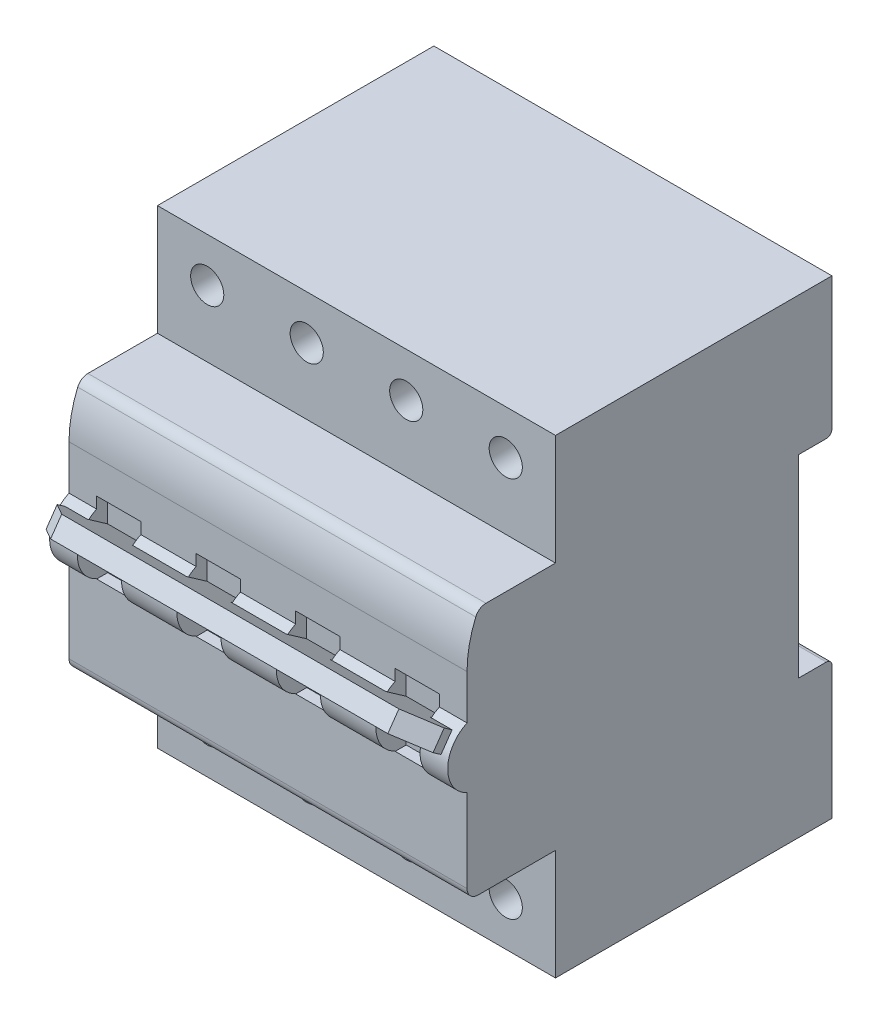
ISO-10303-21;
HEADER;
FILE_DESCRIPTION(('STEP AP214'),'2;1');
FILE_NAME('part.step','',(''),(''),'','','');
FILE_SCHEMA(('AUTOMOTIVE_DESIGN { 1 0 10303 214 1 1 1 1 }'));
ENDSEC;
DATA;
#1=APPLICATION_CONTEXT('core data for automotive mechanical design processes');
#2=APPLICATION_PROTOCOL_DEFINITION('international standard','automotive_design',2000,#1);
#3=PRODUCT_CONTEXT('',#1,'mechanical');
#4=PRODUCT('Part','Part','',(#3));
#5=PRODUCT_RELATED_PRODUCT_CATEGORY('part','',(#4));
#6=PRODUCT_DEFINITION_FORMATION('','',#4);
#7=PRODUCT_DEFINITION_CONTEXT('part definition',#1,'design');
#8=PRODUCT_DEFINITION('design','',#6,#7);
#9=PRODUCT_DEFINITION_SHAPE('','',#8);
#10=(LENGTH_UNIT() NAMED_UNIT(*) SI_UNIT(.MILLI.,.METRE.));
#11=(NAMED_UNIT(*) PLANE_ANGLE_UNIT() SI_UNIT($,.RADIAN.));
#12=(NAMED_UNIT(*) SI_UNIT($,.STERADIAN.) SOLID_ANGLE_UNIT());
#13=UNCERTAINTY_MEASURE_WITH_UNIT(LENGTH_MEASURE(1.E-05),#10,'distance_accuracy_value','');
#14=(GEOMETRIC_REPRESENTATION_CONTEXT(3) GLOBAL_UNCERTAINTY_ASSIGNED_CONTEXT((#13)) GLOBAL_UNIT_ASSIGNED_CONTEXT((#10,
#11,#12)) REPRESENTATION_CONTEXT('',''));
#15=CARTESIAN_POINT('',(0.,0.,0.));
#16=DIRECTION('',(0.,0.,1.));
#17=DIRECTION('',(1.,0.,0.));
#18=AXIS2_PLACEMENT_3D('',#15,#16,#17);
#19=CARTESIAN_POINT('',(-13.,1.,63.));
#20=DIRECTION('',(-1.,0.,0.));
#21=DIRECTION('',(0.,0.,1.));
#22=AXIS2_PLACEMENT_3D('',#19,#20,#21);
#23=PLANE('',#22);
#24=DIRECTION('',(0.,-0.573576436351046,-0.819152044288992));
#25=VECTOR('',#24,1.);
#26=CARTESIAN_POINT('',(-13.,4.73158058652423,61.7063654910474));
#27=LINE('',#26,#25);
#28=CARTESIAN_POINT('',(-13.,4.53614796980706,61.4272587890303));
#29=VERTEX_POINT('',#28);
#30=CARTESIAN_POINT('',(-13.,2.13635553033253,58.));
#31=VERTEX_POINT('',#30);
#32=EDGE_CURVE('E535',#29,#31,#27,.T.);
#33=ORIENTED_EDGE('',*,*,#32,.T.);
#34=DIRECTION('',(0.,1.,0.));
#35=VECTOR('',#34,1.);
#36=CARTESIAN_POINT('',(-13.,1.,58.));
#37=LINE('',#36,#35);
#38=CARTESIAN_POINT('',(-13.,7.50000000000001,58.));
#39=VERTEX_POINT('',#38);
#40=EDGE_CURVE('E901',#31,#39,#37,.T.);
#41=ORIENTED_EDGE('',*,*,#40,.T.);
#42=DIRECTION('',(0.,0.,1.));
#43=VECTOR('',#42,1.);
#44=CARTESIAN_POINT('',(-13.,7.50000000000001,63.));
#45=LINE('',#44,#43);
#46=CARTESIAN_POINT('',(-13.,7.50000000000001,60.));
#47=VERTEX_POINT('',#46);
#48=EDGE_CURVE('E897',#39,#47,#45,.T.);
#49=ORIENTED_EDGE('',*,*,#48,.T.);
#50=DIRECTION('',(0.,-1.,0.));
#51=VECTOR('',#50,1.);
#52=CARTESIAN_POINT('',(-13.,13.5,60.));
#53=LINE('',#52,#51);
#54=CARTESIAN_POINT('',(-13.,5.45435605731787,60.));
#55=VERTEX_POINT('',#54);
#56=EDGE_CURVE('E1134',#47,#55,#53,.T.);
#57=ORIENTED_EDGE('',*,*,#56,.T.);
#58=CARTESIAN_POINT('',(-13.,0.,57.5));
#59=DIRECTION('',(-1.,0.,0.));
#60=DIRECTION('',(0.,0.,1.));
#61=AXIS2_PLACEMENT_3D('',#58,#59,#60);
#62=CIRCLE('',#61,6.);
#63=EDGE_CURVE('E34',#29,#55,#62,.T.);
#64=ORIENTED_EDGE('',*,*,#63,.F.);
#65=EDGE_LOOP('',(#33,#41,#49,#57,#64));
#66=FACE_BOUND('',#65,.T.);
#67=ADVANCED_FACE('F16',(#66),#23,.F.);
#68=CARTESIAN_POINT('',(-5.,1.,58.));
#69=DIRECTION('',(0.,0.,-1.));
#70=DIRECTION('',(-1.,0.,0.));
#71=AXIS2_PLACEMENT_3D('',#68,#69,#70);
#72=PLANE('',#71);
#73=DIRECTION('',(-1.,0.,0.));
#74=VECTOR('',#73,1.);
#75=CARTESIAN_POINT('',(-5.,2.13635553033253,58.));
#76=LINE('',#75,#74);
#77=CARTESIAN_POINT('',(-5.,2.13635553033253,58.));
#78=VERTEX_POINT('',#77);
#79=EDGE_CURVE('E699',#78,#31,#76,.T.);
#80=ORIENTED_EDGE('',*,*,#79,.F.);
#81=DIRECTION('',(0.,-1.,0.));
#82=VECTOR('',#81,1.);
#83=CARTESIAN_POINT('',(-5.,1.,58.));
#84=LINE('',#83,#82);
#85=CARTESIAN_POINT('',(-5.,7.50000000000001,58.));
#86=VERTEX_POINT('',#85);
#87=EDGE_CURVE('E887',#86,#78,#84,.T.);
#88=ORIENTED_EDGE('',*,*,#87,.F.);
#89=DIRECTION('',(-1.,0.,0.));
#90=VECTOR('',#89,1.);
#91=CARTESIAN_POINT('',(-5.,7.50000000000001,58.));
#92=LINE('',#91,#90);
#93=EDGE_CURVE('E886',#86,#39,#92,.T.);
#94=ORIENTED_EDGE('',*,*,#93,.T.);
#95=ORIENTED_EDGE('',*,*,#40,.F.);
#96=EDGE_LOOP('',(#80,#88,#94,#95));
#97=FACE_BOUND('',#96,.T.);
#98=ADVANCED_FACE('F1266',(#97),#72,.F.);
#99=CARTESIAN_POINT('',(-5.,1.,63.));
#100=DIRECTION('',(1.,0.,0.));
#101=DIRECTION('',(0.,0.,-1.));
#102=AXIS2_PLACEMENT_3D('',#99,#100,#101);
#103=PLANE('',#102);
#104=DIRECTION('',(0.,-0.573576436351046,-0.819152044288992));
#105=VECTOR('',#104,1.);
#106=CARTESIAN_POINT('',(-5.,4.73158058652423,61.7063654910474));
#107=LINE('',#106,#105);
#108=CARTESIAN_POINT('',(-5.,4.53614796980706,61.4272587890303));
#109=VERTEX_POINT('',#108);
#110=EDGE_CURVE('E530',#109,#78,#107,.T.);
#111=ORIENTED_EDGE('',*,*,#110,.F.);
#112=CARTESIAN_POINT('',(-5.,0.,57.5));
#113=DIRECTION('',(1.,0.,0.));
#114=DIRECTION('',(0.,0.,-1.));
#115=AXIS2_PLACEMENT_3D('',#112,#113,#114);
#116=CIRCLE('',#115,6.);
#117=CARTESIAN_POINT('',(-5.,5.45435605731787,60.));
#118=VERTEX_POINT('',#117);
#119=EDGE_CURVE('E909',#118,#109,#116,.T.);
#120=ORIENTED_EDGE('',*,*,#119,.F.);
#121=DIRECTION('',(0.,1.,0.));
#122=VECTOR('',#121,1.);
#123=CARTESIAN_POINT('',(-5.,13.5,60.));
#124=LINE('',#123,#122);
#125=CARTESIAN_POINT('',(-5.,7.50000000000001,60.));
#126=VERTEX_POINT('',#125);
#127=EDGE_CURVE('E1061',#118,#126,#124,.T.);
#128=ORIENTED_EDGE('',*,*,#127,.T.);
#129=DIRECTION('',(0.,0.,-1.));
#130=VECTOR('',#129,1.);
#131=CARTESIAN_POINT('',(-5.,7.50000000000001,63.));
#132=LINE('',#131,#130);
#133=EDGE_CURVE('E883',#126,#86,#132,.T.);
#134=ORIENTED_EDGE('',*,*,#133,.T.);
#135=ORIENTED_EDGE('',*,*,#87,.T.);
#136=EDGE_LOOP('',(#111,#120,#128,#134,#135));
#137=FACE_BOUND('',#136,.T.);
#138=ADVANCED_FACE('F1272',(#137),#103,.F.);
#139=CARTESIAN_POINT('',(-31.,1.,63.));
#140=DIRECTION('',(-1.,0.,0.));
#141=DIRECTION('',(0.,0.,1.));
#142=AXIS2_PLACEMENT_3D('',#139,#140,#141);
#143=PLANE('',#142);
#144=DIRECTION('',(0.,-0.573576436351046,-0.819152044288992));
#145=VECTOR('',#144,1.);
#146=CARTESIAN_POINT('',(-31.,4.73158058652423,61.7063654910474));
#147=LINE('',#146,#145);
#148=CARTESIAN_POINT('',(-31.,4.53614796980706,61.4272587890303));
#149=VERTEX_POINT('',#148);
#150=CARTESIAN_POINT('',(-31.,2.13635553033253,58.));
#151=VERTEX_POINT('',#150);
#152=EDGE_CURVE('E548',#149,#151,#147,.T.);
#153=ORIENTED_EDGE('',*,*,#152,.T.);
#154=DIRECTION('',(0.,1.,0.));
#155=VECTOR('',#154,1.);
#156=CARTESIAN_POINT('',(-31.,1.,58.));
#157=LINE('',#156,#155);
#158=CARTESIAN_POINT('',(-31.,7.50000000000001,58.));
#159=VERTEX_POINT('',#158);
#160=EDGE_CURVE('E852',#151,#159,#157,.T.);
#161=ORIENTED_EDGE('',*,*,#160,.T.);
#162=DIRECTION('',(0.,0.,1.));
#163=VECTOR('',#162,1.);
#164=CARTESIAN_POINT('',(-31.,7.50000000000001,63.));
#165=LINE('',#164,#163);
#166=CARTESIAN_POINT('',(-31.,7.50000000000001,60.));
#167=VERTEX_POINT('',#166);
#168=EDGE_CURVE('E848',#159,#167,#165,.T.);
#169=ORIENTED_EDGE('',*,*,#168,.T.);
#170=DIRECTION('',(0.,-1.,0.));
#171=VECTOR('',#170,1.);
#172=CARTESIAN_POINT('',(-31.,13.5,60.));
#173=LINE('',#172,#171);
#174=CARTESIAN_POINT('',(-31.,5.45435605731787,60.));
#175=VERTEX_POINT('',#174);
#176=EDGE_CURVE('E1146',#167,#175,#173,.T.);
#177=ORIENTED_EDGE('',*,*,#176,.T.);
#178=CARTESIAN_POINT('',(-31.,0.,57.5));
#179=DIRECTION('',(-1.,0.,0.));
#180=DIRECTION('',(0.,0.,1.));
#181=AXIS2_PLACEMENT_3D('',#178,#179,#180);
#182=CIRCLE('',#181,6.);
#183=EDGE_CURVE('E870',#149,#175,#182,.T.);
#184=ORIENTED_EDGE('',*,*,#183,.F.);
#185=EDGE_LOOP('',(#153,#161,#169,#177,#184));
#186=FACE_BOUND('',#185,.T.);
#187=ADVANCED_FACE('F1354',(#186),#143,.F.);
#188=CARTESIAN_POINT('',(-23.,1.,58.));
#189=DIRECTION('',(0.,0.,-1.));
#190=DIRECTION('',(-1.,0.,0.));
#191=AXIS2_PLACEMENT_3D('',#188,#189,#190);
#192=PLANE('',#191);
#193=DIRECTION('',(-1.,0.,0.));
#194=VECTOR('',#193,1.);
#195=CARTESIAN_POINT('',(-23.,2.13635553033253,58.));
#196=LINE('',#195,#194);
#197=CARTESIAN_POINT('',(-23.,2.13635553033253,58.));
#198=VERTEX_POINT('',#197);
#199=EDGE_CURVE('E695',#198,#151,#196,.T.);
#200=ORIENTED_EDGE('',*,*,#199,.F.);
#201=DIRECTION('',(0.,-1.,0.));
#202=VECTOR('',#201,1.);
#203=CARTESIAN_POINT('',(-23.,1.,58.));
#204=LINE('',#203,#202);
#205=CARTESIAN_POINT('',(-23.,7.50000000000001,58.));
#206=VERTEX_POINT('',#205);
#207=EDGE_CURVE('E838',#206,#198,#204,.T.);
#208=ORIENTED_EDGE('',*,*,#207,.F.);
#209=DIRECTION('',(-1.,0.,0.));
#210=VECTOR('',#209,1.);
#211=CARTESIAN_POINT('',(-23.,7.50000000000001,58.));
#212=LINE('',#211,#210);
#213=EDGE_CURVE('E837',#206,#159,#212,.T.);
#214=ORIENTED_EDGE('',*,*,#213,.T.);
#215=ORIENTED_EDGE('',*,*,#160,.F.);
#216=EDGE_LOOP('',(#200,#208,#214,#215));
#217=FACE_BOUND('',#216,.T.);
#218=ADVANCED_FACE('F1383',(#217),#192,.F.);
#219=CARTESIAN_POINT('',(-23.,1.,63.));
#220=DIRECTION('',(1.,0.,0.));
#221=DIRECTION('',(0.,0.,-1.));
#222=AXIS2_PLACEMENT_3D('',#219,#220,#221);
#223=PLANE('',#222);
#224=DIRECTION('',(0.,-0.573576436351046,-0.819152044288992));
#225=VECTOR('',#224,1.);
#226=CARTESIAN_POINT('',(-23.,4.73158058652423,61.7063654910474));
#227=LINE('',#226,#225);
#228=CARTESIAN_POINT('',(-23.,4.53614796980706,61.4272587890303));
#229=VERTEX_POINT('',#228);
#230=EDGE_CURVE('E543',#229,#198,#227,.T.);
#231=ORIENTED_EDGE('',*,*,#230,.F.);
#232=CARTESIAN_POINT('',(-23.,0.,57.5));
#233=DIRECTION('',(1.,0.,0.));
#234=DIRECTION('',(0.,0.,-1.));
#235=AXIS2_PLACEMENT_3D('',#232,#233,#234);
#236=CIRCLE('',#235,6.);
#237=CARTESIAN_POINT('',(-23.,5.45435605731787,60.));
#238=VERTEX_POINT('',#237);
#239=EDGE_CURVE('E861',#238,#229,#236,.T.);
#240=ORIENTED_EDGE('',*,*,#239,.F.);
#241=DIRECTION('',(0.,1.,0.));
#242=VECTOR('',#241,1.);
#243=CARTESIAN_POINT('',(-23.,13.5,60.));
#244=LINE('',#243,#242);
#245=CARTESIAN_POINT('',(-23.,7.50000000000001,60.));
#246=VERTEX_POINT('',#245);
#247=EDGE_CURVE('E1140',#238,#246,#244,.T.);
#248=ORIENTED_EDGE('',*,*,#247,.T.);
#249=DIRECTION('',(0.,0.,-1.));
#250=VECTOR('',#249,1.);
#251=CARTESIAN_POINT('',(-23.,7.50000000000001,63.));
#252=LINE('',#251,#250);
#253=EDGE_CURVE('E834',#246,#206,#252,.T.);
#254=ORIENTED_EDGE('',*,*,#253,.T.);
#255=ORIENTED_EDGE('',*,*,#207,.T.);
#256=EDGE_LOOP('',(#231,#240,#248,#254,#255));
#257=FACE_BOUND('',#256,.T.);
#258=ADVANCED_FACE('F1407',(#257),#223,.F.);
#259=CARTESIAN_POINT('',(-49.,1.,63.));
#260=DIRECTION('',(-1.,0.,0.));
#261=DIRECTION('',(0.,0.,1.));
#262=AXIS2_PLACEMENT_3D('',#259,#260,#261);
#263=PLANE('',#262);
#264=DIRECTION('',(0.,-0.573576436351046,-0.819152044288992));
#265=VECTOR('',#264,1.);
#266=CARTESIAN_POINT('',(-49.,4.73158058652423,61.7063654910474));
#267=LINE('',#266,#265);
#268=CARTESIAN_POINT('',(-49.,4.53614796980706,61.4272587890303));
#269=VERTEX_POINT('',#268);
#270=CARTESIAN_POINT('',(-49.,2.13635553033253,58.));
#271=VERTEX_POINT('',#270);
#272=EDGE_CURVE('E561',#269,#271,#267,.T.);
#273=ORIENTED_EDGE('',*,*,#272,.T.);
#274=DIRECTION('',(0.,1.,0.));
#275=VECTOR('',#274,1.);
#276=CARTESIAN_POINT('',(-49.,1.,58.));
#277=LINE('',#276,#275);
#278=CARTESIAN_POINT('',(-49.,7.50000000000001,58.));
#279=VERTEX_POINT('',#278);
#280=EDGE_CURVE('E803',#271,#279,#277,.T.);
#281=ORIENTED_EDGE('',*,*,#280,.T.);
#282=DIRECTION('',(0.,0.,1.));
#283=VECTOR('',#282,1.);
#284=CARTESIAN_POINT('',(-49.,7.50000000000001,63.));
#285=LINE('',#284,#283);
#286=CARTESIAN_POINT('',(-49.,7.50000000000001,60.));
#287=VERTEX_POINT('',#286);
#288=EDGE_CURVE('E799',#279,#287,#285,.T.);
#289=ORIENTED_EDGE('',*,*,#288,.T.);
#290=DIRECTION('',(0.,-1.,0.));
#291=VECTOR('',#290,1.);
#292=CARTESIAN_POINT('',(-49.,13.5,60.));
#293=LINE('',#292,#291);
#294=CARTESIAN_POINT('',(-49.,5.45435605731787,60.));
#295=VERTEX_POINT('',#294);
#296=EDGE_CURVE('E1159',#287,#295,#293,.T.);
#297=ORIENTED_EDGE('',*,*,#296,.T.);
#298=CARTESIAN_POINT('',(-49.,0.,57.5));
#299=DIRECTION('',(-1.,0.,0.));
#300=DIRECTION('',(0.,0.,1.));
#301=AXIS2_PLACEMENT_3D('',#298,#299,#300);
#302=CIRCLE('',#301,6.);
#303=EDGE_CURVE('E821',#269,#295,#302,.T.);
#304=ORIENTED_EDGE('',*,*,#303,.F.);
#305=EDGE_LOOP('',(#273,#281,#289,#297,#304));
#306=FACE_BOUND('',#305,.T.);
#307=ADVANCED_FACE('F1419',(#306),#263,.F.);
#308=CARTESIAN_POINT('',(-41.,1.,58.));
#309=DIRECTION('',(0.,0.,-1.));
#310=DIRECTION('',(-1.,0.,0.));
#311=AXIS2_PLACEMENT_3D('',#308,#309,#310);
#312=PLANE('',#311);
#313=DIRECTION('',(-1.,0.,0.));
#314=VECTOR('',#313,1.);
#315=CARTESIAN_POINT('',(-41.,2.13635553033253,58.));
#316=LINE('',#315,#314);
#317=CARTESIAN_POINT('',(-41.,2.13635553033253,58.));
#318=VERTEX_POINT('',#317);
#319=EDGE_CURVE('E691',#318,#271,#316,.T.);
#320=ORIENTED_EDGE('',*,*,#319,.F.);
#321=DIRECTION('',(0.,-1.,0.));
#322=VECTOR('',#321,1.);
#323=CARTESIAN_POINT('',(-41.,1.,58.));
#324=LINE('',#323,#322);
#325=CARTESIAN_POINT('',(-41.,7.50000000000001,58.));
#326=VERTEX_POINT('',#325);
#327=EDGE_CURVE('E789',#326,#318,#324,.T.);
#328=ORIENTED_EDGE('',*,*,#327,.F.);
#329=DIRECTION('',(-1.,0.,0.));
#330=VECTOR('',#329,1.);
#331=CARTESIAN_POINT('',(-41.,7.50000000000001,58.));
#332=LINE('',#331,#330);
#333=EDGE_CURVE('E788',#326,#279,#332,.T.);
#334=ORIENTED_EDGE('',*,*,#333,.T.);
#335=ORIENTED_EDGE('',*,*,#280,.F.);
#336=EDGE_LOOP('',(#320,#328,#334,#335));
#337=FACE_BOUND('',#336,.T.);
#338=ADVANCED_FACE('F1448',(#337),#312,.F.);
#339=CARTESIAN_POINT('',(-41.,1.,63.));
#340=DIRECTION('',(1.,0.,0.));
#341=DIRECTION('',(0.,0.,-1.));
#342=AXIS2_PLACEMENT_3D('',#339,#340,#341);
#343=PLANE('',#342);
#344=DIRECTION('',(0.,-0.573576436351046,-0.819152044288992));
#345=VECTOR('',#344,1.);
#346=CARTESIAN_POINT('',(-41.,4.73158058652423,61.7063654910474));
#347=LINE('',#346,#345);
#348=CARTESIAN_POINT('',(-41.,4.53614796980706,61.4272587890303));
#349=VERTEX_POINT('',#348);
#350=EDGE_CURVE('E556',#349,#318,#347,.T.);
#351=ORIENTED_EDGE('',*,*,#350,.F.);
#352=CARTESIAN_POINT('',(-41.,0.,57.5));
#353=DIRECTION('',(1.,0.,0.));
#354=DIRECTION('',(0.,0.,-1.));
#355=AXIS2_PLACEMENT_3D('',#352,#353,#354);
#356=CIRCLE('',#355,6.);
#357=CARTESIAN_POINT('',(-41.,5.45435605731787,60.));
#358=VERTEX_POINT('',#357);
#359=EDGE_CURVE('E812',#358,#349,#356,.T.);
#360=ORIENTED_EDGE('',*,*,#359,.F.);
#361=DIRECTION('',(0.,1.,0.));
#362=VECTOR('',#361,1.);
#363=CARTESIAN_POINT('',(-41.,13.5,60.));
#364=LINE('',#363,#362);
#365=CARTESIAN_POINT('',(-41.,7.50000000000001,60.));
#366=VERTEX_POINT('',#365);
#367=EDGE_CURVE('E1153',#358,#366,#364,.T.);
#368=ORIENTED_EDGE('',*,*,#367,.T.);
#369=DIRECTION('',(0.,0.,-1.));
#370=VECTOR('',#369,1.);
#371=CARTESIAN_POINT('',(-41.,7.50000000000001,63.));
#372=LINE('',#371,#370);
#373=EDGE_CURVE('E785',#366,#326,#372,.T.);
#374=ORIENTED_EDGE('',*,*,#373,.T.);
#375=ORIENTED_EDGE('',*,*,#327,.T.);
#376=EDGE_LOOP('',(#351,#360,#368,#374,#375));
#377=FACE_BOUND('',#376,.T.);
#378=ADVANCED_FACE('F1472',(#377),#343,.F.);
#379=CARTESIAN_POINT('',(-67.0000000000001,1.,63.));
#380=DIRECTION('',(-1.,0.,0.));
#381=DIRECTION('',(0.,0.,1.));
#382=AXIS2_PLACEMENT_3D('',#379,#380,#381);
#383=PLANE('',#382);
#384=DIRECTION('',(0.,-0.573576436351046,-0.819152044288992));
#385=VECTOR('',#384,1.);
#386=CARTESIAN_POINT('',(-67.0000000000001,4.73158058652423,61.7063654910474));
#387=LINE('',#386,#385);
#388=CARTESIAN_POINT('',(-67.0000000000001,4.53614796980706,61.4272587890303));
#389=VERTEX_POINT('',#388);
#390=CARTESIAN_POINT('',(-67.0000000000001,2.13635553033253,58.));
#391=VERTEX_POINT('',#390);
#392=EDGE_CURVE('E573',#389,#391,#387,.T.);
#393=ORIENTED_EDGE('',*,*,#392,.T.);
#394=DIRECTION('',(0.,1.,0.));
#395=VECTOR('',#394,1.);
#396=CARTESIAN_POINT('',(-67.0000000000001,1.,58.));
#397=LINE('',#396,#395);
#398=CARTESIAN_POINT('',(-67.0000000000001,7.50000000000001,58.));
#399=VERTEX_POINT('',#398);
#400=EDGE_CURVE('E754',#391,#399,#397,.T.);
#401=ORIENTED_EDGE('',*,*,#400,.T.);
#402=DIRECTION('',(0.,0.,1.));
#403=VECTOR('',#402,1.);
#404=CARTESIAN_POINT('',(-67.0000000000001,7.50000000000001,63.));
#405=LINE('',#404,#403);
#406=CARTESIAN_POINT('',(-67.0000000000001,7.50000000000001,60.));
#407=VERTEX_POINT('',#406);
#408=EDGE_CURVE('E750',#399,#407,#405,.T.);
#409=ORIENTED_EDGE('',*,*,#408,.T.);
#410=DIRECTION('',(0.,-1.,0.));
#411=VECTOR('',#410,1.);
#412=CARTESIAN_POINT('',(-67.0000000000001,13.5,60.));
#413=LINE('',#412,#411);
#414=CARTESIAN_POINT('',(-67.0000000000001,5.45435605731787,60.));
#415=VERTEX_POINT('',#414);
#416=EDGE_CURVE('E1172',#407,#415,#413,.T.);
#417=ORIENTED_EDGE('',*,*,#416,.T.);
#418=CARTESIAN_POINT('',(-67.0000000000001,0.,57.5));
#419=DIRECTION('',(-1.,0.,0.));
#420=DIRECTION('',(0.,0.,1.));
#421=AXIS2_PLACEMENT_3D('',#418,#419,#420);
#422=CIRCLE('',#421,6.);
#423=EDGE_CURVE('E772',#389,#415,#422,.T.);
#424=ORIENTED_EDGE('',*,*,#423,.F.);
#425=EDGE_LOOP('',(#393,#401,#409,#417,#424));
#426=FACE_BOUND('',#425,.T.);
#427=ADVANCED_FACE('F1484',(#426),#383,.F.);
#428=CARTESIAN_POINT('',(-58.9999999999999,1.,58.));
#429=DIRECTION('',(0.,0.,-1.));
#430=DIRECTION('',(-1.,0.,0.));
#431=AXIS2_PLACEMENT_3D('',#428,#429,#430);
#432=PLANE('',#431);
#433=DIRECTION('',(-1.,0.,0.));
#434=VECTOR('',#433,1.);
#435=CARTESIAN_POINT('',(-58.9999999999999,2.13635553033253,58.));
#436=LINE('',#435,#434);
#437=CARTESIAN_POINT('',(-58.9999999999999,2.13635553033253,58.));
#438=VERTEX_POINT('',#437);
#439=EDGE_CURVE('E647',#438,#391,#436,.T.);
#440=ORIENTED_EDGE('',*,*,#439,.F.);
#441=DIRECTION('',(0.,-1.,0.));
#442=VECTOR('',#441,1.);
#443=CARTESIAN_POINT('',(-58.9999999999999,1.,58.));
#444=LINE('',#443,#442);
#445=CARTESIAN_POINT('',(-58.9999999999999,7.50000000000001,58.));
#446=VERTEX_POINT('',#445);
#447=EDGE_CURVE('E740',#446,#438,#444,.T.);
#448=ORIENTED_EDGE('',*,*,#447,.F.);
#449=DIRECTION('',(-1.,0.,0.));
#450=VECTOR('',#449,1.);
#451=CARTESIAN_POINT('',(-58.9999999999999,7.50000000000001,58.));
#452=LINE('',#451,#450);
#453=EDGE_CURVE('E739',#446,#399,#452,.T.);
#454=ORIENTED_EDGE('',*,*,#453,.T.);
#455=ORIENTED_EDGE('',*,*,#400,.F.);
#456=EDGE_LOOP('',(#440,#448,#454,#455));
#457=FACE_BOUND('',#456,.T.);
#458=ADVANCED_FACE('F1513',(#457),#432,.F.);
#459=CARTESIAN_POINT('',(-58.9999999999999,1.,63.));
#460=DIRECTION('',(1.,0.,0.));
#461=DIRECTION('',(0.,0.,-1.));
#462=AXIS2_PLACEMENT_3D('',#459,#460,#461);
#463=PLANE('',#462);
#464=DIRECTION('',(0.,-0.573576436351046,-0.819152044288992));
#465=VECTOR('',#464,1.);
#466=CARTESIAN_POINT('',(-58.9999999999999,4.11173755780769,60.8211379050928));
#467=LINE('',#466,#465);
#468=CARTESIAN_POINT('',(-58.9999999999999,4.53614796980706,61.4272587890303));
#469=VERTEX_POINT('',#468);
#470=EDGE_CURVE('E26',#469,#438,#467,.T.);
#471=ORIENTED_EDGE('',*,*,#470,.F.);
#472=CARTESIAN_POINT('',(-58.9999999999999,0.,57.5));
#473=DIRECTION('',(1.,0.,0.));
#474=DIRECTION('',(0.,0.,-1.));
#475=AXIS2_PLACEMENT_3D('',#472,#473,#474);
#476=CIRCLE('',#475,6.);
#477=CARTESIAN_POINT('',(-58.9999999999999,5.45435605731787,60.));
#478=VERTEX_POINT('',#477);
#479=EDGE_CURVE('E763',#478,#469,#476,.T.);
#480=ORIENTED_EDGE('',*,*,#479,.F.);
#481=DIRECTION('',(0.,1.,0.));
#482=VECTOR('',#481,1.);
#483=CARTESIAN_POINT('',(-58.9999999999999,13.5,60.));
#484=LINE('',#483,#482);
#485=CARTESIAN_POINT('',(-58.9999999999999,7.50000000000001,60.));
#486=VERTEX_POINT('',#485);
#487=EDGE_CURVE('E1166',#478,#486,#484,.T.);
#488=ORIENTED_EDGE('',*,*,#487,.T.);
#489=DIRECTION('',(0.,0.,-1.));
#490=VECTOR('',#489,1.);
#491=CARTESIAN_POINT('',(-58.9999999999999,7.50000000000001,63.));
#492=LINE('',#491,#490);
#493=EDGE_CURVE('E736',#486,#446,#492,.T.);
#494=ORIENTED_EDGE('',*,*,#493,.T.);
#495=ORIENTED_EDGE('',*,*,#447,.T.);
#496=EDGE_LOOP('',(#471,#480,#488,#494,#495));
#497=FACE_BOUND('',#496,.T.);
#498=ADVANCED_FACE('F1536',(#497),#463,.F.);
#499=CARTESIAN_POINT('',(-72.,0.,57.5));
#500=DIRECTION('',(1.,0.,0.));
#501=DIRECTION('',(0.,0.,-1.));
#502=AXIS2_PLACEMENT_3D('',#499,#500,#501);
#503=CYLINDRICAL_SURFACE('',#502,6.);
#504=DIRECTION('',(1.,0.,0.));
#505=VECTOR('',#504,1.);
#506=CARTESIAN_POINT('',(-72.,-5.45435605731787,60.));
#507=LINE('',#506,#505);
#508=CARTESIAN_POINT('',(-72.,-5.45435605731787,60.));
#509=VERTEX_POINT('',#508);
#510=CARTESIAN_POINT('',(-67.0000000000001,-5.45435605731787,60.));
#511=VERTEX_POINT('',#510);
#512=EDGE_CURVE('E1083',#509,#511,#507,.T.);
#513=ORIENTED_EDGE('',*,*,#512,.T.);
#514=CARTESIAN_POINT('',(-67.0000000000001,1.56866142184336,63.2913125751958));
#515=VERTEX_POINT('',#514);
#516=EDGE_CURVE('E773',#511,#515,#422,.T.);
#517=ORIENTED_EDGE('',*,*,#516,.T.);
#518=CARTESIAN_POINT('',(-67.0000000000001,0.,57.5));
#519=DIRECTION('',(1.,0.,0.));
#520=DIRECTION('',(0.,1.,0.));
#521=AXIS2_PLACEMENT_3D('',#518,#519,#520);
#522=CIRCLE('',#521,6.);
#523=EDGE_CURVE('E715',#389,#515,#522,.T.);
#524=ORIENTED_EDGE('',*,*,#523,.F.);
#525=ORIENTED_EDGE('',*,*,#423,.T.);
#526=DIRECTION('',(1.,0.,0.));
#527=VECTOR('',#526,1.);
#528=CARTESIAN_POINT('',(-72.,5.45435605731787,60.));
#529=LINE('',#528,#527);
#530=CARTESIAN_POINT('',(-72.,5.45435605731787,60.));
#531=VERTEX_POINT('',#530);
#532=EDGE_CURVE('E1089',#531,#415,#529,.T.);
#533=ORIENTED_EDGE('',*,*,#532,.F.);
#534=CARTESIAN_POINT('',(-72.,0.,57.5));
#535=DIRECTION('',(-1.,0.,0.));
#536=DIRECTION('',(0.,0.,1.));
#537=AXIS2_PLACEMENT_3D('',#534,#535,#536);
#538=CIRCLE('',#537,6.);
#539=EDGE_CURVE('E1028',#509,#531,#538,.T.);
#540=ORIENTED_EDGE('',*,*,#539,.F.);
#541=EDGE_LOOP('',(#513,#517,#524,#525,#533,#540));
#542=FACE_BOUND('',#541,.T.);
#543=ADVANCED_FACE('F2285',(#542),#503,.T.);
#544=EDGE_CURVE('E1093',#478,#295,#529,.T.);
#545=ORIENTED_EDGE('',*,*,#544,.F.);
#546=ORIENTED_EDGE('',*,*,#479,.T.);
#547=CARTESIAN_POINT('',(-58.9999999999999,1.56866142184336,63.2913125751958));
#548=VERTEX_POINT('',#547);
#549=EDGE_CURVE('E768',#469,#548,#476,.T.);
#550=ORIENTED_EDGE('',*,*,#549,.T.);
#551=CARTESIAN_POINT('',(-58.9999999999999,-5.45435605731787,60.));
#552=VERTEX_POINT('',#551);
#553=EDGE_CURVE('E762',#548,#552,#476,.T.);
#554=ORIENTED_EDGE('',*,*,#553,.T.);
#555=CARTESIAN_POINT('',(-49.,-5.45435605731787,60.));
#556=VERTEX_POINT('',#555);
#557=EDGE_CURVE('E1087',#552,#556,#507,.T.);
#558=ORIENTED_EDGE('',*,*,#557,.T.);
#559=CARTESIAN_POINT('',(-49.,1.56866142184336,63.2913125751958));
#560=VERTEX_POINT('',#559);
#561=EDGE_CURVE('E822',#556,#560,#302,.T.);
#562=ORIENTED_EDGE('',*,*,#561,.T.);
#563=CARTESIAN_POINT('',(-49.,0.,57.5));
#564=DIRECTION('',(1.,0.,0.));
#565=DIRECTION('',(0.,1.,0.));
#566=AXIS2_PLACEMENT_3D('',#563,#564,#565);
#567=CIRCLE('',#566,6.);
#568=EDGE_CURVE('E719',#269,#560,#567,.T.);
#569=ORIENTED_EDGE('',*,*,#568,.F.);
#570=ORIENTED_EDGE('',*,*,#303,.T.);
#571=EDGE_LOOP('',(#545,#546,#550,#554,#558,#562,#569,#570));
#572=FACE_BOUND('',#571,.T.);
#573=ADVANCED_FACE('F2298',(#572),#503,.T.);
#574=EDGE_CURVE('E2403',#358,#175,#529,.T.);
#575=ORIENTED_EDGE('',*,*,#574,.F.);
#576=ORIENTED_EDGE('',*,*,#359,.T.);
#577=CARTESIAN_POINT('',(-41.,1.56866142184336,63.2913125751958));
#578=VERTEX_POINT('',#577);
#579=EDGE_CURVE('E817',#349,#578,#356,.T.);
#580=ORIENTED_EDGE('',*,*,#579,.T.);
#581=CARTESIAN_POINT('',(-41.,-5.45435605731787,60.));
#582=VERTEX_POINT('',#581);
#583=EDGE_CURVE('E811',#578,#582,#356,.T.);
#584=ORIENTED_EDGE('',*,*,#583,.T.);
#585=CARTESIAN_POINT('',(-31.,-5.45435605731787,60.));
#586=VERTEX_POINT('',#585);
#587=EDGE_CURVE('E2393',#582,#586,#507,.T.);
#588=ORIENTED_EDGE('',*,*,#587,.T.);
#589=CARTESIAN_POINT('',(-31.,1.56866142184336,63.2913125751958));
#590=VERTEX_POINT('',#589);
#591=EDGE_CURVE('E871',#586,#590,#182,.T.);
#592=ORIENTED_EDGE('',*,*,#591,.T.);
#593=CARTESIAN_POINT('',(-31.,0.,57.5));
#594=DIRECTION('',(1.,0.,0.));
#595=DIRECTION('',(0.,1.,0.));
#596=AXIS2_PLACEMENT_3D('',#593,#594,#595);
#597=CIRCLE('',#596,6.);
#598=EDGE_CURVE('E723',#149,#590,#597,.T.);
#599=ORIENTED_EDGE('',*,*,#598,.F.);
#600=ORIENTED_EDGE('',*,*,#183,.T.);
#601=EDGE_LOOP('',(#575,#576,#580,#584,#588,#592,#599,#600));
#602=FACE_BOUND('',#601,.T.);
#603=ADVANCED_FACE('F2321',(#602),#503,.T.);
#604=EDGE_CURVE('E2399',#238,#55,#529,.T.);
#605=ORIENTED_EDGE('',*,*,#604,.F.);
#606=ORIENTED_EDGE('',*,*,#239,.T.);
#607=CARTESIAN_POINT('',(-23.,1.56866142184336,63.2913125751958));
#608=VERTEX_POINT('',#607);
#609=EDGE_CURVE('E866',#229,#608,#236,.T.);
#610=ORIENTED_EDGE('',*,*,#609,.T.);
#611=CARTESIAN_POINT('',(-23.,-5.45435605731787,60.));
#612=VERTEX_POINT('',#611);
#613=EDGE_CURVE('E860',#608,#612,#236,.T.);
#614=ORIENTED_EDGE('',*,*,#613,.T.);
#615=CARTESIAN_POINT('',(-13.,-5.45435605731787,60.));
#616=VERTEX_POINT('',#615);
#617=EDGE_CURVE('E2390',#612,#616,#507,.T.);
#618=ORIENTED_EDGE('',*,*,#617,.T.);
#619=CARTESIAN_POINT('',(-13.,1.56866142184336,63.2913125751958));
#620=VERTEX_POINT('',#619);
#621=EDGE_CURVE('E918',#616,#620,#62,.T.);
#622=ORIENTED_EDGE('',*,*,#621,.T.);
#623=CARTESIAN_POINT('',(-13.,0.,57.5));
#624=DIRECTION('',(1.,0.,0.));
#625=DIRECTION('',(0.,1.,0.));
#626=AXIS2_PLACEMENT_3D('',#623,#624,#625);
#627=CIRCLE('',#626,6.);
#628=EDGE_CURVE('E727',#29,#620,#627,.T.);
#629=ORIENTED_EDGE('',*,*,#628,.F.);
#630=ORIENTED_EDGE('',*,*,#63,.T.);
#631=EDGE_LOOP('',(#605,#606,#610,#614,#618,#622,#629,#630));
#632=FACE_BOUND('',#631,.T.);
#633=ADVANCED_FACE('F2286',(#632),#503,.T.);
#634=CARTESIAN_POINT('',(-72.,-17.5,0.));
#635=DIRECTION('',(0.,-1.,0.));
#636=DIRECTION('',(0.,0.,1.));
#637=AXIS2_PLACEMENT_3D('',#634,#635,#636);
#638=PLANE('',#637);
#639=DIRECTION('',(0.,0.,-1.));
#640=VECTOR('',#639,1.);
#641=CARTESIAN_POINT('',(0.,-17.5,0.));
#642=LINE('',#641,#640);
#643=CARTESIAN_POINT('',(0.,-17.5,0.));
#644=VERTEX_POINT('',#643);
#645=CARTESIAN_POINT('',(0.,-17.5,-5.));
#646=VERTEX_POINT('',#645);
#647=EDGE_CURVE('E924',#644,#646,#642,.T.);
#648=ORIENTED_EDGE('',*,*,#647,.T.);
#649=DIRECTION('',(1.,0.,0.));
#650=VECTOR('',#649,1.);
#651=CARTESIAN_POINT('',(-72.,-17.5,-5.));
#652=LINE('',#651,#650);
#653=CARTESIAN_POINT('',(-72.,-17.5,-5.));
#654=VERTEX_POINT('',#653);
#655=EDGE_CURVE('E1057',#654,#646,#652,.T.);
#656=ORIENTED_EDGE('',*,*,#655,.F.);
#657=DIRECTION('',(0.,0.,-1.));
#658=VECTOR('',#657,1.);
#659=CARTESIAN_POINT('',(-72.,-17.5,0.));
#660=LINE('',#659,#658);
#661=CARTESIAN_POINT('',(-72.,-17.5,0.));
#662=VERTEX_POINT('',#661);
#663=EDGE_CURVE('E928',#662,#654,#660,.T.);
#664=ORIENTED_EDGE('',*,*,#663,.F.);
#665=DIRECTION('',(1.,0.,0.));
#666=VECTOR('',#665,1.);
#667=CARTESIAN_POINT('',(-72.,-17.5,0.));
#668=LINE('',#667,#666);
#669=EDGE_CURVE('E996',#662,#644,#668,.T.);
#670=ORIENTED_EDGE('',*,*,#669,.T.);
#671=EDGE_LOOP('',(#648,#656,#664,#670));
#672=FACE_BOUND('',#671,.T.);
#673=ADVANCED_FACE('F18',(#672),#638,.F.);
#674=CARTESIAN_POINT('',(-72.,-18.5,-5.));
#675=DIRECTION('',(1.,0.,0.));
#676=DIRECTION('',(0.,0.,-1.));
#677=AXIS2_PLACEMENT_3D('',#674,#675,#676);
#678=CYLINDRICAL_SURFACE('',#677,1.);
#679=CARTESIAN_POINT('',(0.,-18.5,-5.));
#680=DIRECTION('',(-1.,0.,0.));
#681=DIRECTION('',(0.,0.,1.));
#682=AXIS2_PLACEMENT_3D('',#679,#680,#681);
#683=CIRCLE('',#682,1.);
#684=CARTESIAN_POINT('',(0.,-18.5,-6.));
#685=VERTEX_POINT('',#684);
#686=EDGE_CURVE('E987',#646,#685,#683,.T.);
#687=ORIENTED_EDGE('',*,*,#686,.T.);
#688=DIRECTION('',(1.,0.,0.));
#689=VECTOR('',#688,1.);
#690=CARTESIAN_POINT('',(-72.,-18.5,-6.));
#691=LINE('',#690,#689);
#692=CARTESIAN_POINT('',(-72.,-18.5,-6.));
#693=VERTEX_POINT('',#692);
#694=EDGE_CURVE('E1062',#693,#685,#691,.T.);
#695=ORIENTED_EDGE('',*,*,#694,.F.);
#696=CARTESIAN_POINT('',(-72.,-18.5,-5.));
#697=DIRECTION('',(-1.,0.,0.));
#698=DIRECTION('',(0.,0.,1.));
#699=AXIS2_PLACEMENT_3D('',#696,#697,#698);
#700=CIRCLE('',#699,1.);
#701=EDGE_CURVE('E1051',#654,#693,#700,.T.);
#702=ORIENTED_EDGE('',*,*,#701,.F.);
#703=ORIENTED_EDGE('',*,*,#655,.T.);
#704=EDGE_LOOP('',(#687,#695,#702,#703));
#705=FACE_BOUND('',#704,.T.);
#706=ADVANCED_FACE('F2342',(#705),#678,.T.);
#707=CARTESIAN_POINT('',(-72.,-18.5,-6.));
#708=DIRECTION('',(0.,0.,1.));
#709=DIRECTION('',(1.,0.,0.));
#710=AXIS2_PLACEMENT_3D('',#707,#708,#709);
#711=PLANE('',#710);
#712=DIRECTION('',(0.,-1.,0.));
#713=VECTOR('',#712,1.);
#714=CARTESIAN_POINT('',(0.,-18.5,-6.));
#715=LINE('',#714,#713);
#716=CARTESIAN_POINT('',(0.,-42.5,-6.));
#717=VERTEX_POINT('',#716);
#718=EDGE_CURVE('E984',#685,#717,#715,.T.);
#719=ORIENTED_EDGE('',*,*,#718,.T.);
#720=DIRECTION('',(1.,0.,0.));
#721=VECTOR('',#720,1.);
#722=CARTESIAN_POINT('',(-72.,-42.5,-6.));
#723=LINE('',#722,#721);
#724=CARTESIAN_POINT('',(-72.,-42.5,-6.));
#725=VERTEX_POINT('',#724);
#726=EDGE_CURVE('E1066',#725,#717,#723,.T.);
#727=ORIENTED_EDGE('',*,*,#726,.F.);
#728=DIRECTION('',(0.,-1.,0.));
#729=VECTOR('',#728,1.);
#730=CARTESIAN_POINT('',(-72.,-18.5,-6.));
#731=LINE('',#730,#729);
#732=EDGE_CURVE('E1048',#693,#725,#731,.T.);
#733=ORIENTED_EDGE('',*,*,#732,.F.);
#734=ORIENTED_EDGE('',*,*,#694,.T.);
#735=EDGE_LOOP('',(#719,#727,#733,#734));
#736=FACE_BOUND('',#735,.T.);
#737=ADVANCED_FACE('F1978',(#736),#711,.F.);
#738=CARTESIAN_POINT('',(-72.,-42.5,-6.));
#739=DIRECTION('',(0.,1.,0.));
#740=DIRECTION('',(-1.,0.,0.));
#741=AXIS2_PLACEMENT_3D('',#738,#739,#740);
#742=PLANE('',#741);
#743=DIRECTION('',(0.,0.,1.));
#744=VECTOR('',#743,1.);
#745=CARTESIAN_POINT('',(0.,-42.5,-6.));
#746=LINE('',#745,#744);
#747=CARTESIAN_POINT('',(0.,-42.5,44.));
#748=VERTEX_POINT('',#747);
#749=EDGE_CURVE('E980',#717,#748,#746,.T.);
#750=ORIENTED_EDGE('',*,*,#749,.T.);
#751=DIRECTION('',(1.,0.,0.));
#752=VECTOR('',#751,1.);
#753=CARTESIAN_POINT('',(-72.,-42.5,44.));
#754=LINE('',#753,#752);
#755=CARTESIAN_POINT('',(-72.,-42.5,44.));
#756=VERTEX_POINT('',#755);
#757=EDGE_CURVE('E1070',#756,#748,#754,.T.);
#758=ORIENTED_EDGE('',*,*,#757,.F.);
#759=DIRECTION('',(0.,0.,1.));
#760=VECTOR('',#759,1.);
#761=CARTESIAN_POINT('',(-72.,-42.5,-6.));
#762=LINE('',#761,#760);
#763=EDGE_CURVE('E1045',#725,#756,#762,.T.);
#764=ORIENTED_EDGE('',*,*,#763,.F.);
#765=ORIENTED_EDGE('',*,*,#726,.T.);
#766=EDGE_LOOP('',(#750,#758,#764,#765));
#767=FACE_BOUND('',#766,.T.);
#768=ADVANCED_FACE('F1971',(#767),#742,.F.);
#769=CARTESIAN_POINT('',(-72.,-22.5,44.));
#770=DIRECTION('',(0.,0.,1.));
#771=DIRECTION('',(1.,0.,0.));
#772=AXIS2_PLACEMENT_3D('',#769,#770,#771);
#773=PLANE('',#772);
#774=CARTESIAN_POINT('',(-63.0000000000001,-34.5,44.));
#775=DIRECTION('',(0.,0.,1.));
#776=DIRECTION('',(1.,0.,0.));
#777=AXIS2_PLACEMENT_3D('',#774,#775,#776);
#778=CIRCLE('',#777,3.);
#779=CARTESIAN_POINT('',(-60.0000000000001,-34.5,44.));
#780=VERTEX_POINT('',#779);
#781=EDGE_CURVE('E20',#780,#780,#778,.T.);
#782=ORIENTED_EDGE('',*,*,#781,.F.);
#783=EDGE_LOOP('',(#782));
#784=FACE_BOUND('',#783,.T.);
#785=CARTESIAN_POINT('',(-45.,-34.5,44.));
#786=DIRECTION('',(0.,0.,1.));
#787=DIRECTION('',(1.,0.,0.));
#788=AXIS2_PLACEMENT_3D('',#785,#786,#787);
#789=CIRCLE('',#788,3.);
#790=CARTESIAN_POINT('',(-42.,-34.5,44.));
#791=VERTEX_POINT('',#790);
#792=EDGE_CURVE('E1209',#791,#791,#789,.T.);
#793=ORIENTED_EDGE('',*,*,#792,.F.);
#794=EDGE_LOOP('',(#793));
#795=FACE_BOUND('',#794,.T.);
#796=CARTESIAN_POINT('',(-27.,-34.5,44.));
#797=DIRECTION('',(0.,0.,1.));
#798=DIRECTION('',(1.,0.,0.));
#799=AXIS2_PLACEMENT_3D('',#796,#797,#798);
#800=CIRCLE('',#799,3.);
#801=CARTESIAN_POINT('',(-24.,-34.5,44.));
#802=VERTEX_POINT('',#801);
#803=EDGE_CURVE('E1205',#802,#802,#800,.T.);
#804=ORIENTED_EDGE('',*,*,#803,.F.);
#805=EDGE_LOOP('',(#804));
#806=FACE_BOUND('',#805,.T.);
#807=CARTESIAN_POINT('',(-9.00000000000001,-34.5,44.));
#808=DIRECTION('',(0.,0.,1.));
#809=DIRECTION('',(1.,0.,0.));
#810=AXIS2_PLACEMENT_3D('',#807,#808,#809);
#811=CIRCLE('',#810,3.);
#812=CARTESIAN_POINT('',(-6.00000000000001,-34.5,44.));
#813=VERTEX_POINT('',#812);
#814=EDGE_CURVE('E1200',#813,#813,#811,.T.);
#815=ORIENTED_EDGE('',*,*,#814,.F.);
#816=EDGE_LOOP('',(#815));
#817=FACE_BOUND('',#816,.T.);
#818=DIRECTION('',(0.,-1.,0.));
#819=VECTOR('',#818,1.);
#820=CARTESIAN_POINT('',(0.,-22.5,44.));
#821=LINE('',#820,#819);
#822=CARTESIAN_POINT('',(0.,-22.5,44.));
#823=VERTEX_POINT('',#822);
#824=EDGE_CURVE('E976',#823,#748,#821,.T.);
#825=ORIENTED_EDGE('',*,*,#824,.F.);
#826=DIRECTION('',(1.,0.,0.));
#827=VECTOR('',#826,1.);
#828=CARTESIAN_POINT('',(-72.,-22.5,44.));
#829=LINE('',#828,#827);
#830=CARTESIAN_POINT('',(-72.,-22.5,44.));
#831=VERTEX_POINT('',#830);
#832=EDGE_CURVE('E1073',#831,#823,#829,.T.);
#833=ORIENTED_EDGE('',*,*,#832,.F.);
#834=DIRECTION('',(0.,-1.,0.));
#835=VECTOR('',#834,1.);
#836=CARTESIAN_POINT('',(-72.,-22.5,44.));
#837=LINE('',#836,#835);
#838=EDGE_CURVE('E1041',#831,#756,#837,.T.);
#839=ORIENTED_EDGE('',*,*,#838,.T.);
#840=ORIENTED_EDGE('',*,*,#757,.T.);
#841=EDGE_LOOP('',(#825,#833,#839,#840));
#842=FACE_BOUND('',#841,.T.);
#843=ADVANCED_FACE('F1977',(#784,#795,#806,#817,#842),#773,.T.);
#844=CARTESIAN_POINT('',(-72.,-22.5,44.));
#845=DIRECTION('',(0.,1.,0.));
#846=DIRECTION('',(0.,0.,-1.));
#847=AXIS2_PLACEMENT_3D('',#844,#845,#846);
#848=PLANE('',#847);
#849=DIRECTION('',(0.,0.,1.));
#850=VECTOR('',#849,1.);
#851=CARTESIAN_POINT('',(0.,-22.5,44.));
#852=LINE('',#851,#850);
#853=CARTESIAN_POINT('',(0.,-22.5,58.));
#854=VERTEX_POINT('',#853);
#855=EDGE_CURVE('E973',#823,#854,#852,.T.);
#856=ORIENTED_EDGE('',*,*,#855,.T.);
#857=DIRECTION('',(1.,0.,0.));
#858=VECTOR('',#857,1.);
#859=CARTESIAN_POINT('',(-72.,-22.5,58.));
#860=LINE('',#859,#858);
#861=CARTESIAN_POINT('',(-72.,-22.5,58.));
#862=VERTEX_POINT('',#861);
#863=EDGE_CURVE('E1076',#862,#854,#860,.T.);
#864=ORIENTED_EDGE('',*,*,#863,.F.);
#865=DIRECTION('',(0.,0.,1.));
#866=VECTOR('',#865,1.);
#867=CARTESIAN_POINT('',(-72.,-22.5,44.));
#868=LINE('',#867,#866);
#869=EDGE_CURVE('E1038',#831,#862,#868,.T.);
#870=ORIENTED_EDGE('',*,*,#869,.F.);
#871=ORIENTED_EDGE('',*,*,#832,.T.);
#872=EDGE_LOOP('',(#856,#864,#870,#871));
#873=FACE_BOUND('',#872,.T.);
#874=ADVANCED_FACE('F1992',(#873),#848,.F.);
#875=CARTESIAN_POINT('',(-72.,-20.5,58.));
#876=DIRECTION('',(1.,0.,0.));
#877=DIRECTION('',(0.,0.,-1.));
#878=AXIS2_PLACEMENT_3D('',#875,#876,#877);
#879=CYLINDRICAL_SURFACE('',#878,2.);
#880=CARTESIAN_POINT('',(0.,-20.5,58.));
#881=DIRECTION('',(-1.,0.,0.));
#882=DIRECTION('',(0.,0.,1.));
#883=AXIS2_PLACEMENT_3D('',#880,#881,#882);
#884=CIRCLE('',#883,2.);
#885=CARTESIAN_POINT('',(0.,-20.5,60.));
#886=VERTEX_POINT('',#885);
#887=EDGE_CURVE('E969',#854,#886,#884,.T.);
#888=ORIENTED_EDGE('',*,*,#887,.T.);
#889=DIRECTION('',(1.,0.,0.));
#890=VECTOR('',#889,1.);
#891=CARTESIAN_POINT('',(-72.,-20.5,60.));
#892=LINE('',#891,#890);
#893=CARTESIAN_POINT('',(-72.,-20.5,60.));
#894=VERTEX_POINT('',#893);
#895=EDGE_CURVE('E1080',#894,#886,#892,.T.);
#896=ORIENTED_EDGE('',*,*,#895,.F.);
#897=CARTESIAN_POINT('',(-72.,-20.5,58.));
#898=DIRECTION('',(-1.,0.,0.));
#899=DIRECTION('',(0.,0.,1.));
#900=AXIS2_PLACEMENT_3D('',#897,#898,#899);
#901=CIRCLE('',#900,2.);
#902=EDGE_CURVE('E1035',#862,#894,#901,.T.);
#903=ORIENTED_EDGE('',*,*,#902,.F.);
#904=ORIENTED_EDGE('',*,*,#863,.T.);
#905=EDGE_LOOP('',(#888,#896,#903,#904));
#906=FACE_BOUND('',#905,.T.);
#907=ADVANCED_FACE('F2004',(#906),#879,.T.);
#908=CARTESIAN_POINT('',(-72.,-5.45435605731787,60.));
#909=DIRECTION('',(0.,0.,1.));
#910=DIRECTION('',(1.,0.,0.));
#911=AXIS2_PLACEMENT_3D('',#908,#909,#910);
#912=PLANE('',#911);
#913=DIRECTION('',(0.,-1.,0.));
#914=VECTOR('',#913,1.);
#915=CARTESIAN_POINT('',(-67.0000000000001,-5.45435605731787,60.));
#916=LINE('',#915,#914);
#917=CARTESIAN_POINT('',(-67.0000000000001,-5.50000000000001,60.));
#918=VERTEX_POINT('',#917);
#919=EDGE_CURVE('E777',#511,#918,#916,.T.);
#920=ORIENTED_EDGE('',*,*,#919,.F.);
#921=ORIENTED_EDGE('',*,*,#512,.F.);
#922=DIRECTION('',(0.,-1.,0.));
#923=VECTOR('',#922,1.);
#924=CARTESIAN_POINT('',(-72.,-5.45435605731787,60.));
#925=LINE('',#924,#923);
#926=EDGE_CURVE('E1031',#509,#894,#925,.T.);
#927=ORIENTED_EDGE('',*,*,#926,.T.);
#928=ORIENTED_EDGE('',*,*,#895,.T.);
#929=DIRECTION('',(0.,-1.,0.));
#930=VECTOR('',#929,1.);
#931=CARTESIAN_POINT('',(0.,-5.45435605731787,60.));
#932=LINE('',#931,#930);
#933=CARTESIAN_POINT('',(0.,-5.45435605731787,60.));
#934=VERTEX_POINT('',#933);
#935=EDGE_CURVE('E965',#934,#886,#932,.T.);
#936=ORIENTED_EDGE('',*,*,#935,.F.);
#937=CARTESIAN_POINT('',(-5.,-5.45435605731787,60.));
#938=VERTEX_POINT('',#937);
#939=EDGE_CURVE('E1088',#938,#934,#507,.T.);
#940=ORIENTED_EDGE('',*,*,#939,.F.);
#941=DIRECTION('',(0.,1.,0.));
#942=VECTOR('',#941,1.);
#943=CARTESIAN_POINT('',(-5.,-5.45435605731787,60.));
#944=LINE('',#943,#942);
#945=CARTESIAN_POINT('',(-5.,-5.50000000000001,60.));
#946=VERTEX_POINT('',#945);
#947=EDGE_CURVE('E913',#946,#938,#944,.T.);
#948=ORIENTED_EDGE('',*,*,#947,.F.);
#949=DIRECTION('',(1.,0.,0.));
#950=VECTOR('',#949,1.);
#951=CARTESIAN_POINT('',(-72.,-5.50000000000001,60.));
#952=LINE('',#951,#950);
#953=CARTESIAN_POINT('',(-13.,-5.50000000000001,60.));
#954=VERTEX_POINT('',#953);
#955=EDGE_CURVE('E1137',#954,#946,#952,.T.);
#956=ORIENTED_EDGE('',*,*,#955,.F.);
#957=DIRECTION('',(0.,-1.,0.));
#958=VECTOR('',#957,1.);
#959=CARTESIAN_POINT('',(-13.,-5.45435605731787,60.));
#960=LINE('',#959,#958);
#961=EDGE_CURVE('E921',#616,#954,#960,.T.);
#962=ORIENTED_EDGE('',*,*,#961,.F.);
#963=ORIENTED_EDGE('',*,*,#617,.F.);
#964=DIRECTION('',(0.,1.,0.));
#965=VECTOR('',#964,1.);
#966=CARTESIAN_POINT('',(-23.,-5.45435605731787,60.));
#967=LINE('',#966,#965);
#968=CARTESIAN_POINT('',(-23.,-5.50000000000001,60.));
#969=VERTEX_POINT('',#968);
#970=EDGE_CURVE('E865',#969,#612,#967,.T.);
#971=ORIENTED_EDGE('',*,*,#970,.F.);
#972=DIRECTION('',(1.,0.,0.));
#973=VECTOR('',#972,1.);
#974=CARTESIAN_POINT('',(-72.,-5.50000000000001,60.));
#975=LINE('',#974,#973);
#976=CARTESIAN_POINT('',(-31.,-5.50000000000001,60.));
#977=VERTEX_POINT('',#976);
#978=EDGE_CURVE('E1150',#977,#969,#975,.T.);
#979=ORIENTED_EDGE('',*,*,#978,.F.);
#980=DIRECTION('',(0.,-1.,0.));
#981=VECTOR('',#980,1.);
#982=CARTESIAN_POINT('',(-31.,-5.45435605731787,60.));
#983=LINE('',#982,#981);
#984=EDGE_CURVE('E875',#586,#977,#983,.T.);
#985=ORIENTED_EDGE('',*,*,#984,.F.);
#986=ORIENTED_EDGE('',*,*,#587,.F.);
#987=DIRECTION('',(0.,1.,0.));
#988=VECTOR('',#987,1.);
#989=CARTESIAN_POINT('',(-41.,-5.45435605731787,60.));
#990=LINE('',#989,#988);
#991=CARTESIAN_POINT('',(-41.,-5.50000000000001,60.));
#992=VERTEX_POINT('',#991);
#993=EDGE_CURVE('E816',#992,#582,#990,.T.);
#994=ORIENTED_EDGE('',*,*,#993,.F.);
#995=DIRECTION('',(1.,0.,0.));
#996=VECTOR('',#995,1.);
#997=CARTESIAN_POINT('',(-72.,-5.50000000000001,60.));
#998=LINE('',#997,#996);
#999=CARTESIAN_POINT('',(-49.,-5.50000000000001,60.));
#1000=VERTEX_POINT('',#999);
#1001=EDGE_CURVE('E1163',#1000,#992,#998,.T.);
#1002=ORIENTED_EDGE('',*,*,#1001,.F.);
#1003=DIRECTION('',(0.,-1.,0.));
#1004=VECTOR('',#1003,1.);
#1005=CARTESIAN_POINT('',(-49.,-5.45435605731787,60.));
#1006=LINE('',#1005,#1004);
#1007=EDGE_CURVE('E826',#556,#1000,#1006,.T.);
#1008=ORIENTED_EDGE('',*,*,#1007,.F.);
#1009=ORIENTED_EDGE('',*,*,#557,.F.);
#1010=DIRECTION('',(0.,1.,0.));
#1011=VECTOR('',#1010,1.);
#1012=CARTESIAN_POINT('',(-58.9999999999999,-5.45435605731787,60.));
#1013=LINE('',#1012,#1011);
#1014=CARTESIAN_POINT('',(-58.9999999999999,-5.50000000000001,60.));
#1015=VERTEX_POINT('',#1014);
#1016=EDGE_CURVE('E767',#1015,#552,#1013,.T.);
#1017=ORIENTED_EDGE('',*,*,#1016,.F.);
#1018=DIRECTION('',(1.,0.,0.));
#1019=VECTOR('',#1018,1.);
#1020=CARTESIAN_POINT('',(-72.,-5.50000000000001,60.));
#1021=LINE('',#1020,#1019);
#1022=EDGE_CURVE('E1176',#918,#1015,#1021,.T.);
#1023=ORIENTED_EDGE('',*,*,#1022,.F.);
#1024=EDGE_LOOP('',(#920,#921,#927,#928,#936,#940,#948,#956,#962,#963,#971,#979,#985,#986,#994,
#1002,#1008,#1009,#1017,#1023));
#1025=FACE_BOUND('',#1024,.T.);
#1026=ADVANCED_FACE('F2016',(#1025),#912,.T.);
#1027=CARTESIAN_POINT('',(0.,5.45435605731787,60.));
#1028=VERTEX_POINT('',#1027);
#1029=EDGE_CURVE('E1094',#118,#1028,#529,.T.);
#1030=ORIENTED_EDGE('',*,*,#1029,.F.);
#1031=ORIENTED_EDGE('',*,*,#119,.T.);
#1032=CARTESIAN_POINT('',(-5.,1.56866142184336,63.2913125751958));
#1033=VERTEX_POINT('',#1032);
#1034=EDGE_CURVE('E914',#109,#1033,#116,.T.);
#1035=ORIENTED_EDGE('',*,*,#1034,.T.);
#1036=EDGE_CURVE('E908',#1033,#938,#116,.T.);
#1037=ORIENTED_EDGE('',*,*,#1036,.T.);
#1038=ORIENTED_EDGE('',*,*,#939,.T.);
#1039=CARTESIAN_POINT('',(0.,0.,57.5));
#1040=DIRECTION('',(-1.,0.,0.));
#1041=DIRECTION('',(0.,0.,1.));
#1042=AXIS2_PLACEMENT_3D('',#1039,#1040,#1041);
#1043=CIRCLE('',#1042,6.);
#1044=EDGE_CURVE('E961',#934,#1028,#1043,.T.);
#1045=ORIENTED_EDGE('',*,*,#1044,.T.);
#1046=EDGE_LOOP('',(#1030,#1031,#1035,#1037,#1038,#1045));
#1047=FACE_BOUND('',#1046,.T.);
#1048=ADVANCED_FACE('F2262',(#1047),#503,.T.);
#1049=CARTESIAN_POINT('',(-72.,13.5,60.));
#1050=DIRECTION('',(0.,0.,1.));
#1051=DIRECTION('',(0.,1.,0.));
#1052=AXIS2_PLACEMENT_3D('',#1049,#1050,#1051);
#1053=PLANE('',#1052);
#1054=ORIENTED_EDGE('',*,*,#416,.F.);
#1055=DIRECTION('',(-1.,0.,0.));
#1056=VECTOR('',#1055,1.);
#1057=CARTESIAN_POINT('',(-72.,7.50000000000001,60.));
#1058=LINE('',#1057,#1056);
#1059=EDGE_CURVE('E1169',#486,#407,#1058,.T.);
#1060=ORIENTED_EDGE('',*,*,#1059,.F.);
#1061=ORIENTED_EDGE('',*,*,#487,.F.);
#1062=ORIENTED_EDGE('',*,*,#544,.T.);
#1063=ORIENTED_EDGE('',*,*,#296,.F.);
#1064=DIRECTION('',(-1.,0.,0.));
#1065=VECTOR('',#1064,1.);
#1066=CARTESIAN_POINT('',(-72.,7.50000000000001,60.));
#1067=LINE('',#1066,#1065);
#1068=EDGE_CURVE('E1156',#366,#287,#1067,.T.);
#1069=ORIENTED_EDGE('',*,*,#1068,.F.);
#1070=ORIENTED_EDGE('',*,*,#367,.F.);
#1071=ORIENTED_EDGE('',*,*,#574,.T.);
#1072=ORIENTED_EDGE('',*,*,#176,.F.);
#1073=DIRECTION('',(-1.,0.,0.));
#1074=VECTOR('',#1073,1.);
#1075=CARTESIAN_POINT('',(-72.,7.50000000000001,60.));
#1076=LINE('',#1075,#1074);
#1077=EDGE_CURVE('E1143',#246,#167,#1076,.T.);
#1078=ORIENTED_EDGE('',*,*,#1077,.F.);
#1079=ORIENTED_EDGE('',*,*,#247,.F.);
#1080=ORIENTED_EDGE('',*,*,#604,.T.);
#1081=ORIENTED_EDGE('',*,*,#56,.F.);
#1082=DIRECTION('',(-1.,0.,0.));
#1083=VECTOR('',#1082,1.);
#1084=CARTESIAN_POINT('',(-72.,7.50000000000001,60.));
#1085=LINE('',#1084,#1083);
#1086=EDGE_CURVE('E1131',#126,#47,#1085,.T.);
#1087=ORIENTED_EDGE('',*,*,#1086,.F.);
#1088=ORIENTED_EDGE('',*,*,#127,.F.);
#1089=ORIENTED_EDGE('',*,*,#1029,.T.);
#1090=DIRECTION('',(0.,-1.,0.));
#1091=VECTOR('',#1090,1.);
#1092=CARTESIAN_POINT('',(0.,13.5,60.));
#1093=LINE('',#1092,#1091);
#1094=CARTESIAN_POINT('',(0.,13.5,60.));
#1095=VERTEX_POINT('',#1094);
#1096=EDGE_CURVE('E957',#1095,#1028,#1093,.T.);
#1097=ORIENTED_EDGE('',*,*,#1096,.F.);
#1098=DIRECTION('',(1.,0.,0.));
#1099=VECTOR('',#1098,1.);
#1100=CARTESIAN_POINT('',(-72.,13.5,60.));
#1101=LINE('',#1100,#1099);
#1102=CARTESIAN_POINT('',(-72.,13.5,60.));
#1103=VERTEX_POINT('',#1102);
#1104=EDGE_CURVE('E1095',#1103,#1095,#1101,.T.);
#1105=ORIENTED_EDGE('',*,*,#1104,.F.);
#1106=DIRECTION('',(0.,-1.,0.));
#1107=VECTOR('',#1106,1.);
#1108=CARTESIAN_POINT('',(-72.,13.5,60.));
#1109=LINE('',#1108,#1107);
#1110=EDGE_CURVE('E1024',#1103,#531,#1109,.T.);
#1111=ORIENTED_EDGE('',*,*,#1110,.T.);
#1112=ORIENTED_EDGE('',*,*,#532,.T.);
#1113=EDGE_LOOP('',(#1054,#1060,#1061,#1062,#1063,#1069,#1070,#1071,#1072,#1078,#1079,#1080,
#1081,#1087,#1088,#1089,#1097,#1105,#1111,#1112));
#1114=FACE_BOUND('',#1113,.T.);
#1115=ADVANCED_FACE('F2032',(#1114),#1053,.T.);
#1116=CARTESIAN_POINT('',(-72.,13.5,40.));
#1117=DIRECTION('',(1.,0.,0.));
#1118=DIRECTION('',(0.,0.,-1.));
#1119=AXIS2_PLACEMENT_3D('',#1116,#1117,#1118);
#1120=CYLINDRICAL_SURFACE('',#1119,20.);
#1121=CARTESIAN_POINT('',(0.,13.5,40.));
#1122=DIRECTION('',(-1.,0.,0.));
#1123=DIRECTION('',(0.,0.,1.));
#1124=AXIS2_PLACEMENT_3D('',#1121,#1122,#1123);
#1125=CIRCLE('',#1124,20.);
#1126=CARTESIAN_POINT('',(0.,21.2777777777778,58.4256932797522));
#1127=VERTEX_POINT('',#1126);
#1128=EDGE_CURVE('E954',#1095,#1127,#1125,.T.);
#1129=ORIENTED_EDGE('',*,*,#1128,.T.);
#1130=DIRECTION('',(1.,0.,0.));
#1131=VECTOR('',#1130,1.);
#1132=CARTESIAN_POINT('',(-72.,21.2777777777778,58.4256932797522));
#1133=LINE('',#1132,#1131);
#1134=CARTESIAN_POINT('',(-72.,21.2777777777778,58.4256932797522));
#1135=VERTEX_POINT('',#1134);
#1136=EDGE_CURVE('E1098',#1135,#1127,#1133,.T.);
#1137=ORIENTED_EDGE('',*,*,#1136,.F.);
#1138=CARTESIAN_POINT('',(-72.,13.5,40.));
#1139=DIRECTION('',(-1.,0.,0.));
#1140=DIRECTION('',(0.,0.,1.));
#1141=AXIS2_PLACEMENT_3D('',#1138,#1139,#1140);
#1142=CIRCLE('',#1141,20.);
#1143=EDGE_CURVE('E1021',#1103,#1135,#1142,.T.);
#1144=ORIENTED_EDGE('',*,*,#1143,.F.);
#1145=ORIENTED_EDGE('',*,*,#1104,.T.);
#1146=EDGE_LOOP('',(#1129,#1137,#1144,#1145));
#1147=FACE_BOUND('',#1146,.T.);
#1148=ADVANCED_FACE('F2025',(#1147),#1120,.T.);
#1149=CARTESIAN_POINT('',(-72.,20.5,56.583123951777));
#1150=DIRECTION('',(1.,0.,0.));
#1151=DIRECTION('',(0.,0.,-1.));
#1152=AXIS2_PLACEMENT_3D('',#1149,#1150,#1151);
#1153=CYLINDRICAL_SURFACE('',#1152,2.);
#1154=CARTESIAN_POINT('',(0.,20.5,56.583123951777));
#1155=DIRECTION('',(-1.,0.,0.));
#1156=DIRECTION('',(0.,0.,1.));
#1157=AXIS2_PLACEMENT_3D('',#1154,#1155,#1156);
#1158=CIRCLE('',#1157,2.);
#1159=CARTESIAN_POINT('',(0.,22.5,56.583123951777));
#1160=VERTEX_POINT('',#1159);
#1161=EDGE_CURVE('E950',#1127,#1160,#1158,.T.);
#1162=ORIENTED_EDGE('',*,*,#1161,.T.);
#1163=DIRECTION('',(1.,0.,0.));
#1164=VECTOR('',#1163,1.);
#1165=CARTESIAN_POINT('',(-72.,22.5,56.583123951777));
#1166=LINE('',#1165,#1164);
#1167=CARTESIAN_POINT('',(-72.,22.5,56.583123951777));
#1168=VERTEX_POINT('',#1167);
#1169=EDGE_CURVE('E1102',#1168,#1160,#1166,.T.);
#1170=ORIENTED_EDGE('',*,*,#1169,.F.);
#1171=CARTESIAN_POINT('',(-72.,20.5,56.583123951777));
#1172=DIRECTION('',(-1.,0.,0.));
#1173=DIRECTION('',(0.,0.,1.));
#1174=AXIS2_PLACEMENT_3D('',#1171,#1172,#1173);
#1175=CIRCLE('',#1174,2.);
#1176=EDGE_CURVE('E1018',#1135,#1168,#1175,.T.);
#1177=ORIENTED_EDGE('',*,*,#1176,.F.);
#1178=ORIENTED_EDGE('',*,*,#1136,.T.);
#1179=EDGE_LOOP('',(#1162,#1170,#1177,#1178));
#1180=FACE_BOUND('',#1179,.T.);
#1181=ADVANCED_FACE('F2031',(#1180),#1153,.T.);
#1182=CARTESIAN_POINT('',(-72.,22.5,44.));
#1183=DIRECTION('',(0.,1.,0.));
#1184=DIRECTION('',(-1.,0.,0.));
#1185=AXIS2_PLACEMENT_3D('',#1182,#1183,#1184);
#1186=PLANE('',#1185);
#1187=DIRECTION('',(0.,0.,1.));
#1188=VECTOR('',#1187,1.);
#1189=CARTESIAN_POINT('',(0.,22.5,44.));
#1190=LINE('',#1189,#1188);
#1191=CARTESIAN_POINT('',(0.,22.5,44.));
#1192=VERTEX_POINT('',#1191);
#1193=EDGE_CURVE('E946',#1192,#1160,#1190,.T.);
#1194=ORIENTED_EDGE('',*,*,#1193,.F.);
#1195=DIRECTION('',(1.,0.,0.));
#1196=VECTOR('',#1195,1.);
#1197=CARTESIAN_POINT('',(-72.,22.5,44.));
#1198=LINE('',#1197,#1196);
#1199=CARTESIAN_POINT('',(-72.,22.5,44.));
#1200=VERTEX_POINT('',#1199);
#1201=EDGE_CURVE('E1105',#1200,#1192,#1198,.T.);
#1202=ORIENTED_EDGE('',*,*,#1201,.F.);
#1203=DIRECTION('',(0.,0.,1.));
#1204=VECTOR('',#1203,1.);
#1205=CARTESIAN_POINT('',(-72.,22.5,44.));
#1206=LINE('',#1205,#1204);
#1207=EDGE_CURVE('E1014',#1200,#1168,#1206,.T.);
#1208=ORIENTED_EDGE('',*,*,#1207,.T.);
#1209=ORIENTED_EDGE('',*,*,#1169,.T.);
#1210=EDGE_LOOP('',(#1194,#1202,#1208,#1209));
#1211=FACE_BOUND('',#1210,.T.);
#1212=ADVANCED_FACE('F2046',(#1211),#1186,.T.);
#1213=CARTESIAN_POINT('',(-72.,42.5,44.));
#1214=DIRECTION('',(0.,0.,1.));
#1215=DIRECTION('',(1.,0.,0.));
#1216=AXIS2_PLACEMENT_3D('',#1213,#1214,#1215);
#1217=PLANE('',#1216);
#1218=CARTESIAN_POINT('',(-63.0000000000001,34.5,44.));
#1219=DIRECTION('',(0.,0.,1.));
#1220=DIRECTION('',(1.,0.,0.));
#1221=AXIS2_PLACEMENT_3D('',#1218,#1219,#1220);
#1222=CIRCLE('',#1221,3.);
#1223=CARTESIAN_POINT('',(-60.0000000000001,34.5,44.));
#1224=VERTEX_POINT('',#1223);
#1225=EDGE_CURVE('E1195',#1224,#1224,#1222,.T.);
#1226=ORIENTED_EDGE('',*,*,#1225,.F.);
#1227=EDGE_LOOP('',(#1226));
#1228=FACE_BOUND('',#1227,.T.);
#1229=CARTESIAN_POINT('',(-45.,34.5,44.));
#1230=DIRECTION('',(0.,0.,1.));
#1231=DIRECTION('',(1.,0.,0.));
#1232=AXIS2_PLACEMENT_3D('',#1229,#1230,#1231);
#1233=CIRCLE('',#1232,3.);
#1234=CARTESIAN_POINT('',(-42.,34.5,44.));
#1235=VERTEX_POINT('',#1234);
#1236=EDGE_CURVE('E1190',#1235,#1235,#1233,.T.);
#1237=ORIENTED_EDGE('',*,*,#1236,.F.);
#1238=EDGE_LOOP('',(#1237));
#1239=FACE_BOUND('',#1238,.T.);
#1240=CARTESIAN_POINT('',(-27.,34.5,44.));
#1241=DIRECTION('',(0.,0.,1.));
#1242=DIRECTION('',(1.,0.,0.));
#1243=AXIS2_PLACEMENT_3D('',#1240,#1241,#1242);
#1244=CIRCLE('',#1243,3.);
#1245=CARTESIAN_POINT('',(-24.,34.5,44.));
#1246=VERTEX_POINT('',#1245);
#1247=EDGE_CURVE('E1185',#1246,#1246,#1244,.T.);
#1248=ORIENTED_EDGE('',*,*,#1247,.F.);
#1249=EDGE_LOOP('',(#1248));
#1250=FACE_BOUND('',#1249,.T.);
#1251=CARTESIAN_POINT('',(-9.00000000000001,34.5,44.));
#1252=DIRECTION('',(0.,0.,1.));
#1253=DIRECTION('',(1.,0.,0.));
#1254=AXIS2_PLACEMENT_3D('',#1251,#1252,#1253);
#1255=CIRCLE('',#1254,3.);
#1256=CARTESIAN_POINT('',(-6.00000000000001,34.5,44.));
#1257=VERTEX_POINT('',#1256);
#1258=EDGE_CURVE('E500',#1257,#1257,#1255,.T.);
#1259=ORIENTED_EDGE('',*,*,#1258,.F.);
#1260=EDGE_LOOP('',(#1259));
#1261=FACE_BOUND('',#1260,.T.);
#1262=DIRECTION('',(0.,-1.,0.));
#1263=VECTOR('',#1262,1.);
#1264=CARTESIAN_POINT('',(0.,42.5,44.));
#1265=LINE('',#1264,#1263);
#1266=CARTESIAN_POINT('',(0.,42.5,44.));
#1267=VERTEX_POINT('',#1266);
#1268=EDGE_CURVE('E942',#1267,#1192,#1265,.T.);
#1269=ORIENTED_EDGE('',*,*,#1268,.F.);
#1270=DIRECTION('',(1.,0.,0.));
#1271=VECTOR('',#1270,1.);
#1272=CARTESIAN_POINT('',(-72.,42.5,44.));
#1273=LINE('',#1272,#1271);
#1274=CARTESIAN_POINT('',(-72.,42.5,44.));
#1275=VERTEX_POINT('',#1274);
#1276=EDGE_CURVE('E1108',#1275,#1267,#1273,.T.);
#1277=ORIENTED_EDGE('',*,*,#1276,.F.);
#1278=DIRECTION('',(0.,-1.,0.));
#1279=VECTOR('',#1278,1.);
#1280=CARTESIAN_POINT('',(-72.,42.5,44.));
#1281=LINE('',#1280,#1279);
#1282=EDGE_CURVE('E1010',#1275,#1200,#1281,.T.);
#1283=ORIENTED_EDGE('',*,*,#1282,.T.);
#1284=ORIENTED_EDGE('',*,*,#1201,.T.);
#1285=EDGE_LOOP('',(#1269,#1277,#1283,#1284));
#1286=FACE_BOUND('',#1285,.T.);
#1287=ADVANCED_FACE('F2058',(#1228,#1239,#1250,#1261,#1286),#1217,.T.);
#1288=CARTESIAN_POINT('',(-72.,42.5,-6.));
#1289=DIRECTION('',(0.,1.,0.));
#1290=DIRECTION('',(-1.,0.,0.));
#1291=AXIS2_PLACEMENT_3D('',#1288,#1289,#1290);
#1292=PLANE('',#1291);
#1293=DIRECTION('',(0.,0.,1.));
#1294=VECTOR('',#1293,1.);
#1295=CARTESIAN_POINT('',(0.,42.5,-6.));
#1296=LINE('',#1295,#1294);
#1297=CARTESIAN_POINT('',(0.,42.5,-6.));
#1298=VERTEX_POINT('',#1297);
#1299=EDGE_CURVE('E938',#1298,#1267,#1296,.T.);
#1300=ORIENTED_EDGE('',*,*,#1299,.F.);
#1301=DIRECTION('',(1.,0.,0.));
#1302=VECTOR('',#1301,1.);
#1303=CARTESIAN_POINT('',(-72.,42.5,-6.));
#1304=LINE('',#1303,#1302);
#1305=CARTESIAN_POINT('',(-72.,42.5,-6.));
#1306=VERTEX_POINT('',#1305);
#1307=EDGE_CURVE('E1111',#1306,#1298,#1304,.T.);
#1308=ORIENTED_EDGE('',*,*,#1307,.F.);
#1309=DIRECTION('',(0.,0.,1.));
#1310=VECTOR('',#1309,1.);
#1311=CARTESIAN_POINT('',(-72.,42.5,-6.));
#1312=LINE('',#1311,#1310);
#1313=EDGE_CURVE('E1006',#1306,#1275,#1312,.T.);
#1314=ORIENTED_EDGE('',*,*,#1313,.T.);
#1315=ORIENTED_EDGE('',*,*,#1276,.T.);
#1316=EDGE_LOOP('',(#1300,#1308,#1314,#1315));
#1317=FACE_BOUND('',#1316,.T.);
#1318=ADVANCED_FACE('F2069',(#1317),#1292,.T.);
#1319=CARTESIAN_POINT('',(-72.,42.5,-6.));
#1320=DIRECTION('',(0.,0.,1.));
#1321=DIRECTION('',(1.,0.,0.));
#1322=AXIS2_PLACEMENT_3D('',#1319,#1320,#1321);
#1323=PLANE('',#1322);
#1324=DIRECTION('',(0.,-1.,0.));
#1325=VECTOR('',#1324,1.);
#1326=CARTESIAN_POINT('',(0.,42.5,-6.));
#1327=LINE('',#1326,#1325);
#1328=CARTESIAN_POINT('',(0.,18.5,-6.));
#1329=VERTEX_POINT('',#1328);
#1330=EDGE_CURVE('E935',#1298,#1329,#1327,.T.);
#1331=ORIENTED_EDGE('',*,*,#1330,.T.);
#1332=DIRECTION('',(1.,0.,0.));
#1333=VECTOR('',#1332,1.);
#1334=CARTESIAN_POINT('',(-72.,18.5,-6.));
#1335=LINE('',#1334,#1333);
#1336=CARTESIAN_POINT('',(-72.,18.5,-6.));
#1337=VERTEX_POINT('',#1336);
#1338=EDGE_CURVE('E1114',#1337,#1329,#1335,.T.);
#1339=ORIENTED_EDGE('',*,*,#1338,.F.);
#1340=DIRECTION('',(0.,-1.,0.));
#1341=VECTOR('',#1340,1.);
#1342=CARTESIAN_POINT('',(-72.,42.5,-6.));
#1343=LINE('',#1342,#1341);
#1344=EDGE_CURVE('E1003',#1306,#1337,#1343,.T.);
#1345=ORIENTED_EDGE('',*,*,#1344,.F.);
#1346=ORIENTED_EDGE('',*,*,#1307,.T.);
#1347=EDGE_LOOP('',(#1331,#1339,#1345,#1346));
#1348=FACE_BOUND('',#1347,.T.);
#1349=ADVANCED_FACE('F2080',(#1348),#1323,.F.);
#1350=CARTESIAN_POINT('',(-72.,18.5,-5.));
#1351=DIRECTION('',(1.,0.,0.));
#1352=DIRECTION('',(0.,0.,-1.));
#1353=AXIS2_PLACEMENT_3D('',#1350,#1351,#1352);
#1354=CYLINDRICAL_SURFACE('',#1353,1.);
#1355=CARTESIAN_POINT('',(0.,18.5,-5.));
#1356=DIRECTION('',(-1.,0.,0.));
#1357=DIRECTION('',(0.,0.,1.));
#1358=AXIS2_PLACEMENT_3D('',#1355,#1356,#1357);
#1359=CIRCLE('',#1358,1.);
#1360=CARTESIAN_POINT('',(0.,17.5,-5.));
#1361=VERTEX_POINT('',#1360);
#1362=EDGE_CURVE('E932',#1329,#1361,#1359,.T.);
#1363=ORIENTED_EDGE('',*,*,#1362,.T.);
#1364=DIRECTION('',(1.,0.,0.));
#1365=VECTOR('',#1364,1.);
#1366=CARTESIAN_POINT('',(-72.,17.5,-5.));
#1367=LINE('',#1366,#1365);
#1368=CARTESIAN_POINT('',(-72.,17.5,-5.));
#1369=VERTEX_POINT('',#1368);
#1370=EDGE_CURVE('E1118',#1369,#1361,#1367,.T.);
#1371=ORIENTED_EDGE('',*,*,#1370,.F.);
#1372=CARTESIAN_POINT('',(-72.,18.5,-5.));
#1373=DIRECTION('',(-1.,0.,0.));
#1374=DIRECTION('',(0.,0.,1.));
#1375=AXIS2_PLACEMENT_3D('',#1372,#1373,#1374);
#1376=CIRCLE('',#1375,1.);
#1377=EDGE_CURVE('E1000',#1337,#1369,#1376,.T.);
#1378=ORIENTED_EDGE('',*,*,#1377,.F.);
#1379=ORIENTED_EDGE('',*,*,#1338,.T.);
#1380=EDGE_LOOP('',(#1363,#1371,#1378,#1379));
#1381=FACE_BOUND('',#1380,.T.);
#1382=ADVANCED_FACE('F2095',(#1381),#1354,.T.);
#1383=CARTESIAN_POINT('',(-72.,17.5,-5.));
#1384=DIRECTION('',(0.,1.,0.));
#1385=DIRECTION('',(0.,0.,-1.));
#1386=AXIS2_PLACEMENT_3D('',#1383,#1384,#1385);
#1387=PLANE('',#1386);
#1388=DIRECTION('',(0.,0.,1.));
#1389=VECTOR('',#1388,1.);
#1390=CARTESIAN_POINT('',(0.,17.5,-5.));
#1391=LINE('',#1390,#1389);
#1392=CARTESIAN_POINT('',(0.,17.5,0.));
#1393=VERTEX_POINT('',#1392);
#1394=EDGE_CURVE('E929',#1361,#1393,#1391,.T.);
#1395=ORIENTED_EDGE('',*,*,#1394,.T.);
#1396=DIRECTION('',(1.,0.,0.));
#1397=VECTOR('',#1396,1.);
#1398=CARTESIAN_POINT('',(-72.,17.5,0.));
#1399=LINE('',#1398,#1397);
#1400=CARTESIAN_POINT('',(-72.,17.5,0.));
#1401=VERTEX_POINT('',#1400);
#1402=EDGE_CURVE('E1122',#1401,#1393,#1399,.T.);
#1403=ORIENTED_EDGE('',*,*,#1402,.F.);
#1404=DIRECTION('',(0.,0.,1.));
#1405=VECTOR('',#1404,1.);
#1406=CARTESIAN_POINT('',(-72.,17.5,-5.));
#1407=LINE('',#1406,#1405);
#1408=EDGE_CURVE('E997',#1369,#1401,#1407,.T.);
#1409=ORIENTED_EDGE('',*,*,#1408,.F.);
#1410=ORIENTED_EDGE('',*,*,#1370,.T.);
#1411=EDGE_LOOP('',(#1395,#1403,#1409,#1410));
#1412=FACE_BOUND('',#1411,.T.);
#1413=ADVANCED_FACE('F2106',(#1412),#1387,.F.);
#1414=CARTESIAN_POINT('',(-72.,17.5,0.));
#1415=DIRECTION('',(0.,0.,1.));
#1416=DIRECTION('',(1.,0.,0.));
#1417=AXIS2_PLACEMENT_3D('',#1414,#1415,#1416);
#1418=PLANE('',#1417);
#1419=DIRECTION('',(0.,-1.,0.));
#1420=VECTOR('',#1419,1.);
#1421=CARTESIAN_POINT('',(0.,17.5,0.));
#1422=LINE('',#1421,#1420);
#1423=EDGE_CURVE('E925',#1393,#644,#1422,.T.);
#1424=ORIENTED_EDGE('',*,*,#1423,.T.);
#1425=ORIENTED_EDGE('',*,*,#669,.F.);
#1426=DIRECTION('',(0.,-1.,0.));
#1427=VECTOR('',#1426,1.);
#1428=CARTESIAN_POINT('',(-72.,17.5,0.));
#1429=LINE('',#1428,#1427);
#1430=EDGE_CURVE('E993',#1401,#662,#1429,.T.);
#1431=ORIENTED_EDGE('',*,*,#1430,.F.);
#1432=ORIENTED_EDGE('',*,*,#1402,.T.);
#1433=EDGE_LOOP('',(#1424,#1425,#1431,#1432));
#1434=FACE_BOUND('',#1433,.T.);
#1435=ADVANCED_FACE('F2117',(#1434),#1418,.F.);
#1436=CARTESIAN_POINT('',(-72.,-18.5,-5.));
#1437=DIRECTION('',(-1.,0.,0.));
#1438=DIRECTION('',(0.,0.,1.));
#1439=AXIS2_PLACEMENT_3D('',#1436,#1437,#1438);
#1440=PLANE('',#1439);
#1441=ORIENTED_EDGE('',*,*,#663,.T.);
#1442=ORIENTED_EDGE('',*,*,#701,.T.);
#1443=ORIENTED_EDGE('',*,*,#732,.T.);
#1444=ORIENTED_EDGE('',*,*,#763,.T.);
#1445=ORIENTED_EDGE('',*,*,#838,.F.);
#1446=ORIENTED_EDGE('',*,*,#869,.T.);
#1447=ORIENTED_EDGE('',*,*,#902,.T.);
#1448=ORIENTED_EDGE('',*,*,#926,.F.);
#1449=ORIENTED_EDGE('',*,*,#539,.T.);
#1450=ORIENTED_EDGE('',*,*,#1110,.F.);
#1451=ORIENTED_EDGE('',*,*,#1143,.T.);
#1452=ORIENTED_EDGE('',*,*,#1176,.T.);
#1453=ORIENTED_EDGE('',*,*,#1207,.F.);
#1454=ORIENTED_EDGE('',*,*,#1282,.F.);
#1455=ORIENTED_EDGE('',*,*,#1313,.F.);
#1456=ORIENTED_EDGE('',*,*,#1344,.T.);
#1457=ORIENTED_EDGE('',*,*,#1377,.T.);
#1458=ORIENTED_EDGE('',*,*,#1408,.T.);
#1459=ORIENTED_EDGE('',*,*,#1430,.T.);
#1460=EDGE_LOOP('',(#1441,#1442,#1443,#1444,#1445,#1446,#1447,#1448,#1449,#1450,#1451,#1452,
#1453,#1454,#1455,#1456,#1457,#1458,#1459));
#1461=FACE_BOUND('',#1460,.T.);
#1462=ADVANCED_FACE('F1286',(#1461),#1440,.T.);
#1463=CARTESIAN_POINT('',(0.,-18.5,-5.));
#1464=DIRECTION('',(-1.,0.,0.));
#1465=DIRECTION('',(0.,0.,1.));
#1466=AXIS2_PLACEMENT_3D('',#1463,#1464,#1465);
#1467=PLANE('',#1466);
#1468=ORIENTED_EDGE('',*,*,#647,.F.);
#1469=ORIENTED_EDGE('',*,*,#1423,.F.);
#1470=ORIENTED_EDGE('',*,*,#1394,.F.);
#1471=ORIENTED_EDGE('',*,*,#1362,.F.);
#1472=ORIENTED_EDGE('',*,*,#1330,.F.);
#1473=ORIENTED_EDGE('',*,*,#1299,.T.);
#1474=ORIENTED_EDGE('',*,*,#1268,.T.);
#1475=ORIENTED_EDGE('',*,*,#1193,.T.);
#1476=ORIENTED_EDGE('',*,*,#1161,.F.);
#1477=ORIENTED_EDGE('',*,*,#1128,.F.);
#1478=ORIENTED_EDGE('',*,*,#1096,.T.);
#1479=ORIENTED_EDGE('',*,*,#1044,.F.);
#1480=ORIENTED_EDGE('',*,*,#935,.T.);
#1481=ORIENTED_EDGE('',*,*,#887,.F.);
#1482=ORIENTED_EDGE('',*,*,#855,.F.);
#1483=ORIENTED_EDGE('',*,*,#824,.T.);
#1484=ORIENTED_EDGE('',*,*,#749,.F.);
#1485=ORIENTED_EDGE('',*,*,#718,.F.);
#1486=ORIENTED_EDGE('',*,*,#686,.F.);
#1487=EDGE_LOOP('',(#1468,#1469,#1470,#1471,#1472,#1473,#1474,#1475,#1476,#1477,#1478,#1479,
#1480,#1481,#1482,#1483,#1484,#1485,#1486));
#1488=FACE_BOUND('',#1487,.T.);
#1489=ADVANCED_FACE('F1280',(#1488),#1467,.F.);
#1490=CARTESIAN_POINT('',(-13.,-5.50000000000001,58.));
#1491=VERTEX_POINT('',#1490);
#1492=CARTESIAN_POINT('',(-13.,-2.13635553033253,58.));
#1493=VERTEX_POINT('',#1492);
#1494=EDGE_CURVE('E902',#1491,#1493,#37,.T.);
#1495=ORIENTED_EDGE('',*,*,#1494,.T.);
#1496=DIRECTION('',(0.,-0.573576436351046,-0.819152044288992));
#1497=VECTOR('',#1496,1.);
#1498=CARTESIAN_POINT('',(-13.,1.86454843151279,63.713883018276));
#1499=LINE('',#1498,#1497);
#1500=EDGE_CURVE('E42',#620,#1493,#1499,.T.);
#1501=ORIENTED_EDGE('',*,*,#1500,.F.);
#1502=ORIENTED_EDGE('',*,*,#621,.F.);
#1503=ORIENTED_EDGE('',*,*,#961,.T.);
#1504=DIRECTION('',(0.,0.,-1.));
#1505=VECTOR('',#1504,1.);
#1506=CARTESIAN_POINT('',(-13.,-5.50000000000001,63.));
#1507=LINE('',#1506,#1505);
#1508=EDGE_CURVE('E905',#954,#1491,#1507,.T.);
#1509=ORIENTED_EDGE('',*,*,#1508,.T.);
#1510=EDGE_LOOP('',(#1495,#1501,#1502,#1503,#1509));
#1511=FACE_BOUND('',#1510,.T.);
#1512=ADVANCED_FACE('F1268',(#1511),#23,.F.);
#1513=CARTESIAN_POINT('',(-5.,-5.50000000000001,63.));
#1514=DIRECTION('',(0.,-1.,0.));
#1515=DIRECTION('',(1.,0.,0.));
#1516=AXIS2_PLACEMENT_3D('',#1513,#1514,#1515);
#1517=PLANE('',#1516);
#1518=ORIENTED_EDGE('',*,*,#955,.T.);
#1519=DIRECTION('',(0.,0.,1.));
#1520=VECTOR('',#1519,1.);
#1521=CARTESIAN_POINT('',(-5.,-5.50000000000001,63.));
#1522=LINE('',#1521,#1520);
#1523=CARTESIAN_POINT('',(-5.,-5.50000000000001,58.));
#1524=VERTEX_POINT('',#1523);
#1525=EDGE_CURVE('E878',#1524,#946,#1522,.T.);
#1526=ORIENTED_EDGE('',*,*,#1525,.F.);
#1527=DIRECTION('',(-1.,0.,0.));
#1528=VECTOR('',#1527,1.);
#1529=CARTESIAN_POINT('',(-5.,-5.50000000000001,58.));
#1530=LINE('',#1529,#1528);
#1531=EDGE_CURVE('E893',#1524,#1491,#1530,.T.);
#1532=ORIENTED_EDGE('',*,*,#1531,.T.);
#1533=ORIENTED_EDGE('',*,*,#1508,.F.);
#1534=EDGE_LOOP('',(#1518,#1526,#1532,#1533));
#1535=FACE_BOUND('',#1534,.T.);
#1536=ADVANCED_FACE('F1279',(#1535),#1517,.F.);
#1537=CARTESIAN_POINT('',(-5.,-2.13635553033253,58.));
#1538=VERTEX_POINT('',#1537);
#1539=EDGE_CURVE('E882',#1538,#1524,#84,.T.);
#1540=ORIENTED_EDGE('',*,*,#1539,.F.);
#1541=DIRECTION('',(-1.,0.,0.));
#1542=VECTOR('',#1541,1.);
#1543=CARTESIAN_POINT('',(-5.,-2.13635553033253,58.));
#1544=LINE('',#1543,#1542);
#1545=EDGE_CURVE('E712',#1538,#1493,#1544,.T.);
#1546=ORIENTED_EDGE('',*,*,#1545,.T.);
#1547=ORIENTED_EDGE('',*,*,#1494,.F.);
#1548=ORIENTED_EDGE('',*,*,#1531,.F.);
#1549=EDGE_LOOP('',(#1540,#1546,#1547,#1548));
#1550=FACE_BOUND('',#1549,.T.);
#1551=ADVANCED_FACE('F1275',(#1550),#72,.F.);
#1552=CARTESIAN_POINT('',(-5.,7.50000000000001,63.));
#1553=DIRECTION('',(0.,1.,0.));
#1554=DIRECTION('',(-1.,0.,0.));
#1555=AXIS2_PLACEMENT_3D('',#1552,#1553,#1554);
#1556=PLANE('',#1555);
#1557=ORIENTED_EDGE('',*,*,#1086,.T.);
#1558=ORIENTED_EDGE('',*,*,#48,.F.);
#1559=ORIENTED_EDGE('',*,*,#93,.F.);
#1560=ORIENTED_EDGE('',*,*,#133,.F.);
#1561=EDGE_LOOP('',(#1557,#1558,#1559,#1560));
#1562=FACE_BOUND('',#1561,.T.);
#1563=ADVANCED_FACE('F1319',(#1562),#1556,.F.);
#1564=ORIENTED_EDGE('',*,*,#1036,.F.);
#1565=DIRECTION('',(0.,-0.573576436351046,-0.819152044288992));
#1566=VECTOR('',#1565,1.);
#1567=CARTESIAN_POINT('',(-5.,1.86454843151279,63.713883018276));
#1568=LINE('',#1567,#1566);
#1569=EDGE_CURVE('E596',#1033,#1538,#1568,.T.);
#1570=ORIENTED_EDGE('',*,*,#1569,.T.);
#1571=ORIENTED_EDGE('',*,*,#1539,.T.);
#1572=ORIENTED_EDGE('',*,*,#1525,.T.);
#1573=ORIENTED_EDGE('',*,*,#947,.T.);
#1574=EDGE_LOOP('',(#1564,#1570,#1571,#1572,#1573));
#1575=FACE_BOUND('',#1574,.T.);
#1576=ADVANCED_FACE('F1330',(#1575),#103,.F.);
#1577=CARTESIAN_POINT('',(-31.,-5.50000000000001,58.));
#1578=VERTEX_POINT('',#1577);
#1579=CARTESIAN_POINT('',(-31.,-2.13635553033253,58.));
#1580=VERTEX_POINT('',#1579);
#1581=EDGE_CURVE('E853',#1578,#1580,#157,.T.);
#1582=ORIENTED_EDGE('',*,*,#1581,.T.);
#1583=DIRECTION('',(0.,-0.573576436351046,-0.819152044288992));
#1584=VECTOR('',#1583,1.);
#1585=CARTESIAN_POINT('',(-31.,1.86454843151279,63.713883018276));
#1586=LINE('',#1585,#1584);
#1587=EDGE_CURVE('E613',#590,#1580,#1586,.T.);
#1588=ORIENTED_EDGE('',*,*,#1587,.F.);
#1589=ORIENTED_EDGE('',*,*,#591,.F.);
#1590=ORIENTED_EDGE('',*,*,#984,.T.);
#1591=DIRECTION('',(0.,0.,-1.));
#1592=VECTOR('',#1591,1.);
#1593=CARTESIAN_POINT('',(-31.,-5.50000000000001,63.));
#1594=LINE('',#1593,#1592);
#1595=EDGE_CURVE('E857',#977,#1578,#1594,.T.);
#1596=ORIENTED_EDGE('',*,*,#1595,.T.);
#1597=EDGE_LOOP('',(#1582,#1588,#1589,#1590,#1596));
#1598=FACE_BOUND('',#1597,.T.);
#1599=ADVANCED_FACE('F1340',(#1598),#143,.F.);
#1600=CARTESIAN_POINT('',(-23.,-5.50000000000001,63.));
#1601=DIRECTION('',(0.,-1.,0.));
#1602=DIRECTION('',(1.,0.,0.));
#1603=AXIS2_PLACEMENT_3D('',#1600,#1601,#1602);
#1604=PLANE('',#1603);
#1605=ORIENTED_EDGE('',*,*,#978,.T.);
#1606=DIRECTION('',(0.,0.,1.));
#1607=VECTOR('',#1606,1.);
#1608=CARTESIAN_POINT('',(-23.,-5.50000000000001,63.));
#1609=LINE('',#1608,#1607);
#1610=CARTESIAN_POINT('',(-23.,-5.50000000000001,58.));
#1611=VERTEX_POINT('',#1610);
#1612=EDGE_CURVE('E829',#1611,#969,#1609,.T.);
#1613=ORIENTED_EDGE('',*,*,#1612,.F.);
#1614=DIRECTION('',(-1.,0.,0.));
#1615=VECTOR('',#1614,1.);
#1616=CARTESIAN_POINT('',(-23.,-5.50000000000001,58.));
#1617=LINE('',#1616,#1615);
#1618=EDGE_CURVE('E844',#1611,#1578,#1617,.T.);
#1619=ORIENTED_EDGE('',*,*,#1618,.T.);
#1620=ORIENTED_EDGE('',*,*,#1595,.F.);
#1621=EDGE_LOOP('',(#1605,#1613,#1619,#1620));
#1622=FACE_BOUND('',#1621,.T.);
#1623=ADVANCED_FACE('F1351',(#1622),#1604,.F.);
#1624=CARTESIAN_POINT('',(-23.,-2.13635553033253,58.));
#1625=VERTEX_POINT('',#1624);
#1626=EDGE_CURVE('E833',#1625,#1611,#204,.T.);
#1627=ORIENTED_EDGE('',*,*,#1626,.F.);
#1628=DIRECTION('',(-1.,0.,0.));
#1629=VECTOR('',#1628,1.);
#1630=CARTESIAN_POINT('',(-23.,-2.13635553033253,58.));
#1631=LINE('',#1630,#1629);
#1632=EDGE_CURVE('E709',#1625,#1580,#1631,.T.);
#1633=ORIENTED_EDGE('',*,*,#1632,.T.);
#1634=ORIENTED_EDGE('',*,*,#1581,.F.);
#1635=ORIENTED_EDGE('',*,*,#1618,.F.);
#1636=EDGE_LOOP('',(#1627,#1633,#1634,#1635));
#1637=FACE_BOUND('',#1636,.T.);
#1638=ADVANCED_FACE('F1367',(#1637),#192,.F.);
#1639=CARTESIAN_POINT('',(-23.,7.50000000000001,63.));
#1640=DIRECTION('',(0.,1.,0.));
#1641=DIRECTION('',(-1.,0.,0.));
#1642=AXIS2_PLACEMENT_3D('',#1639,#1640,#1641);
#1643=PLANE('',#1642);
#1644=ORIENTED_EDGE('',*,*,#1077,.T.);
#1645=ORIENTED_EDGE('',*,*,#168,.F.);
#1646=ORIENTED_EDGE('',*,*,#213,.F.);
#1647=ORIENTED_EDGE('',*,*,#253,.F.);
#1648=EDGE_LOOP('',(#1644,#1645,#1646,#1647));
#1649=FACE_BOUND('',#1648,.T.);
#1650=ADVANCED_FACE('F1380',(#1649),#1643,.F.);
#1651=ORIENTED_EDGE('',*,*,#613,.F.);
#1652=DIRECTION('',(0.,-0.573576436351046,-0.819152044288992));
#1653=VECTOR('',#1652,1.);
#1654=CARTESIAN_POINT('',(-23.,1.86454843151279,63.713883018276));
#1655=LINE('',#1654,#1653);
#1656=EDGE_CURVE('E608',#608,#1625,#1655,.T.);
#1657=ORIENTED_EDGE('',*,*,#1656,.T.);
#1658=ORIENTED_EDGE('',*,*,#1626,.T.);
#1659=ORIENTED_EDGE('',*,*,#1612,.T.);
#1660=ORIENTED_EDGE('',*,*,#970,.T.);
#1661=EDGE_LOOP('',(#1651,#1657,#1658,#1659,#1660));
#1662=FACE_BOUND('',#1661,.T.);
#1663=ADVANCED_FACE('F1394',(#1662),#223,.F.);
#1664=CARTESIAN_POINT('',(-49.,-5.50000000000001,58.));
#1665=VERTEX_POINT('',#1664);
#1666=CARTESIAN_POINT('',(-49.,-2.13635553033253,58.));
#1667=VERTEX_POINT('',#1666);
#1668=EDGE_CURVE('E804',#1665,#1667,#277,.T.);
#1669=ORIENTED_EDGE('',*,*,#1668,.T.);
#1670=DIRECTION('',(0.,-0.573576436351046,-0.819152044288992));
#1671=VECTOR('',#1670,1.);
#1672=CARTESIAN_POINT('',(-49.,1.86454843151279,63.713883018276));
#1673=LINE('',#1672,#1671);
#1674=EDGE_CURVE('E626',#560,#1667,#1673,.T.);
#1675=ORIENTED_EDGE('',*,*,#1674,.F.);
#1676=ORIENTED_EDGE('',*,*,#561,.F.);
#1677=ORIENTED_EDGE('',*,*,#1007,.T.);
#1678=DIRECTION('',(0.,0.,-1.));
#1679=VECTOR('',#1678,1.);
#1680=CARTESIAN_POINT('',(-49.,-5.50000000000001,63.));
#1681=LINE('',#1680,#1679);
#1682=EDGE_CURVE('E808',#1000,#1665,#1681,.T.);
#1683=ORIENTED_EDGE('',*,*,#1682,.T.);
#1684=EDGE_LOOP('',(#1669,#1675,#1676,#1677,#1683));
#1685=FACE_BOUND('',#1684,.T.);
#1686=ADVANCED_FACE('F1404',(#1685),#263,.F.);
#1687=CARTESIAN_POINT('',(-41.,-5.50000000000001,63.));
#1688=DIRECTION('',(0.,-1.,0.));
#1689=DIRECTION('',(1.,0.,0.));
#1690=AXIS2_PLACEMENT_3D('',#1687,#1688,#1689);
#1691=PLANE('',#1690);
#1692=ORIENTED_EDGE('',*,*,#1001,.T.);
#1693=DIRECTION('',(0.,0.,1.));
#1694=VECTOR('',#1693,1.);
#1695=CARTESIAN_POINT('',(-41.,-5.50000000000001,63.));
#1696=LINE('',#1695,#1694);
#1697=CARTESIAN_POINT('',(-41.,-5.50000000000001,58.));
#1698=VERTEX_POINT('',#1697);
#1699=EDGE_CURVE('E780',#1698,#992,#1696,.T.);
#1700=ORIENTED_EDGE('',*,*,#1699,.F.);
#1701=DIRECTION('',(-1.,0.,0.));
#1702=VECTOR('',#1701,1.);
#1703=CARTESIAN_POINT('',(-41.,-5.50000000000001,58.));
#1704=LINE('',#1703,#1702);
#1705=EDGE_CURVE('E795',#1698,#1665,#1704,.T.);
#1706=ORIENTED_EDGE('',*,*,#1705,.T.);
#1707=ORIENTED_EDGE('',*,*,#1682,.F.);
#1708=EDGE_LOOP('',(#1692,#1700,#1706,#1707));
#1709=FACE_BOUND('',#1708,.T.);
#1710=ADVANCED_FACE('F1416',(#1709),#1691,.F.);
#1711=CARTESIAN_POINT('',(-41.,-2.13635553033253,58.));
#1712=VERTEX_POINT('',#1711);
#1713=EDGE_CURVE('E784',#1712,#1698,#324,.T.);
#1714=ORIENTED_EDGE('',*,*,#1713,.F.);
#1715=DIRECTION('',(-1.,0.,0.));
#1716=VECTOR('',#1715,1.);
#1717=CARTESIAN_POINT('',(-41.,-2.13635553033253,58.));
#1718=LINE('',#1717,#1716);
#1719=EDGE_CURVE('E706',#1712,#1667,#1718,.T.);
#1720=ORIENTED_EDGE('',*,*,#1719,.T.);
#1721=ORIENTED_EDGE('',*,*,#1668,.F.);
#1722=ORIENTED_EDGE('',*,*,#1705,.F.);
#1723=EDGE_LOOP('',(#1714,#1720,#1721,#1722));
#1724=FACE_BOUND('',#1723,.T.);
#1725=ADVANCED_FACE('F1432',(#1724),#312,.F.);
#1726=CARTESIAN_POINT('',(-41.,7.50000000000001,63.));
#1727=DIRECTION('',(0.,1.,0.));
#1728=DIRECTION('',(-1.,0.,0.));
#1729=AXIS2_PLACEMENT_3D('',#1726,#1727,#1728);
#1730=PLANE('',#1729);
#1731=ORIENTED_EDGE('',*,*,#1068,.T.);
#1732=ORIENTED_EDGE('',*,*,#288,.F.);
#1733=ORIENTED_EDGE('',*,*,#333,.F.);
#1734=ORIENTED_EDGE('',*,*,#373,.F.);
#1735=EDGE_LOOP('',(#1731,#1732,#1733,#1734));
#1736=FACE_BOUND('',#1735,.T.);
#1737=ADVANCED_FACE('F1445',(#1736),#1730,.F.);
#1738=ORIENTED_EDGE('',*,*,#583,.F.);
#1739=DIRECTION('',(0.,-0.573576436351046,-0.819152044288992));
#1740=VECTOR('',#1739,1.);
#1741=CARTESIAN_POINT('',(-41.,1.86454843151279,63.713883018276));
#1742=LINE('',#1741,#1740);
#1743=EDGE_CURVE('E621',#578,#1712,#1742,.T.);
#1744=ORIENTED_EDGE('',*,*,#1743,.T.);
#1745=ORIENTED_EDGE('',*,*,#1713,.T.);
#1746=ORIENTED_EDGE('',*,*,#1699,.T.);
#1747=ORIENTED_EDGE('',*,*,#993,.T.);
#1748=EDGE_LOOP('',(#1738,#1744,#1745,#1746,#1747));
#1749=FACE_BOUND('',#1748,.T.);
#1750=ADVANCED_FACE('F1459',(#1749),#343,.F.);
#1751=CARTESIAN_POINT('',(-67.0000000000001,-5.50000000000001,58.));
#1752=VERTEX_POINT('',#1751);
#1753=CARTESIAN_POINT('',(-67.0000000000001,-2.13635553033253,58.));
#1754=VERTEX_POINT('',#1753);
#1755=EDGE_CURVE('E755',#1752,#1754,#397,.T.);
#1756=ORIENTED_EDGE('',*,*,#1755,.T.);
#1757=DIRECTION('',(0.,-0.573576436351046,-0.819152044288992));
#1758=VECTOR('',#1757,1.);
#1759=CARTESIAN_POINT('',(-67.0000000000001,1.86454843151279,63.713883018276));
#1760=LINE('',#1759,#1758);
#1761=EDGE_CURVE('E638',#515,#1754,#1760,.T.);
#1762=ORIENTED_EDGE('',*,*,#1761,.F.);
#1763=ORIENTED_EDGE('',*,*,#516,.F.);
#1764=ORIENTED_EDGE('',*,*,#919,.T.);
#1765=DIRECTION('',(0.,0.,-1.));
#1766=VECTOR('',#1765,1.);
#1767=CARTESIAN_POINT('',(-67.0000000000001,-5.50000000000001,63.));
#1768=LINE('',#1767,#1766);
#1769=EDGE_CURVE('E759',#918,#1752,#1768,.T.);
#1770=ORIENTED_EDGE('',*,*,#1769,.T.);
#1771=EDGE_LOOP('',(#1756,#1762,#1763,#1764,#1770));
#1772=FACE_BOUND('',#1771,.T.);
#1773=ADVANCED_FACE('F1469',(#1772),#383,.F.);
#1774=CARTESIAN_POINT('',(-58.9999999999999,-5.50000000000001,63.));
#1775=DIRECTION('',(0.,-1.,0.));
#1776=DIRECTION('',(1.,0.,0.));
#1777=AXIS2_PLACEMENT_3D('',#1774,#1775,#1776);
#1778=PLANE('',#1777);
#1779=ORIENTED_EDGE('',*,*,#1022,.T.);
#1780=DIRECTION('',(0.,0.,1.));
#1781=VECTOR('',#1780,1.);
#1782=CARTESIAN_POINT('',(-58.9999999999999,-5.50000000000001,63.));
#1783=LINE('',#1782,#1781);
#1784=CARTESIAN_POINT('',(-58.9999999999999,-5.50000000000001,58.));
#1785=VERTEX_POINT('',#1784);
#1786=EDGE_CURVE('E731',#1785,#1015,#1783,.T.);
#1787=ORIENTED_EDGE('',*,*,#1786,.F.);
#1788=DIRECTION('',(-1.,0.,0.));
#1789=VECTOR('',#1788,1.);
#1790=CARTESIAN_POINT('',(-58.9999999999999,-5.50000000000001,58.));
#1791=LINE('',#1790,#1789);
#1792=EDGE_CURVE('E746',#1785,#1752,#1791,.T.);
#1793=ORIENTED_EDGE('',*,*,#1792,.T.);
#1794=ORIENTED_EDGE('',*,*,#1769,.F.);
#1795=EDGE_LOOP('',(#1779,#1787,#1793,#1794));
#1796=FACE_BOUND('',#1795,.T.);
#1797=ADVANCED_FACE('F1481',(#1796),#1778,.F.);
#1798=CARTESIAN_POINT('',(-58.9999999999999,-2.13635553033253,58.));
#1799=VERTEX_POINT('',#1798);
#1800=EDGE_CURVE('E735',#1799,#1785,#444,.T.);
#1801=ORIENTED_EDGE('',*,*,#1800,.F.);
#1802=DIRECTION('',(-1.,0.,0.));
#1803=VECTOR('',#1802,1.);
#1804=CARTESIAN_POINT('',(-58.9999999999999,-2.13635553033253,58.));
#1805=LINE('',#1804,#1803);
#1806=EDGE_CURVE('E703',#1799,#1754,#1805,.T.);
#1807=ORIENTED_EDGE('',*,*,#1806,.T.);
#1808=ORIENTED_EDGE('',*,*,#1755,.F.);
#1809=ORIENTED_EDGE('',*,*,#1792,.F.);
#1810=EDGE_LOOP('',(#1801,#1807,#1808,#1809));
#1811=FACE_BOUND('',#1810,.T.);
#1812=ADVANCED_FACE('F1497',(#1811),#432,.F.);
#1813=CARTESIAN_POINT('',(-58.9999999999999,7.50000000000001,63.));
#1814=DIRECTION('',(0.,1.,0.));
#1815=DIRECTION('',(-1.,0.,0.));
#1816=AXIS2_PLACEMENT_3D('',#1813,#1814,#1815);
#1817=PLANE('',#1816);
#1818=ORIENTED_EDGE('',*,*,#1059,.T.);
#1819=ORIENTED_EDGE('',*,*,#408,.F.);
#1820=ORIENTED_EDGE('',*,*,#453,.F.);
#1821=ORIENTED_EDGE('',*,*,#493,.F.);
#1822=EDGE_LOOP('',(#1818,#1819,#1820,#1821));
#1823=FACE_BOUND('',#1822,.T.);
#1824=ADVANCED_FACE('F1510',(#1823),#1817,.F.);
#1825=ORIENTED_EDGE('',*,*,#553,.F.);
#1826=DIRECTION('',(0.,-0.573576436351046,-0.819152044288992));
#1827=VECTOR('',#1826,1.);
#1828=CARTESIAN_POINT('',(-58.9999999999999,1.2447054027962,62.8286554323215));
#1829=LINE('',#1828,#1827);
#1830=EDGE_CURVE('E11',#548,#1799,#1829,.T.);
#1831=ORIENTED_EDGE('',*,*,#1830,.T.);
#1832=ORIENTED_EDGE('',*,*,#1800,.T.);
#1833=ORIENTED_EDGE('',*,*,#1786,.T.);
#1834=ORIENTED_EDGE('',*,*,#1016,.T.);
#1835=EDGE_LOOP('',(#1825,#1831,#1832,#1833,#1834));
#1836=FACE_BOUND('',#1835,.T.);
#1837=ADVANCED_FACE('F1524',(#1836),#463,.F.);
#1838=CARTESIAN_POINT('',(-13.,1.86454843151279,63.713883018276));
#1839=DIRECTION('',(1.,0.,0.));
#1840=DIRECTION('',(0.,0.819152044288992,-0.573576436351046));
#1841=AXIS2_PLACEMENT_3D('',#1838,#1839,#1840);
#1842=PLANE('',#1841);
#1843=CARTESIAN_POINT('',(-13.,4.73158058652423,61.7063654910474));
#1844=VERTEX_POINT('',#1843);
#1845=EDGE_CURVE('E531',#1844,#29,#27,.T.);
#1846=ORIENTED_EDGE('',*,*,#1845,.T.);
#1847=ORIENTED_EDGE('',*,*,#628,.T.);
#1848=CARTESIAN_POINT('',(-13.,1.86454843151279,63.713883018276));
#1849=VERTEX_POINT('',#1848);
#1850=EDGE_CURVE('E597',#1849,#620,#1499,.T.);
#1851=ORIENTED_EDGE('',*,*,#1850,.F.);
#1852=DIRECTION('',(0.,0.819152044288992,-0.573576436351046));
#1853=VECTOR('',#1852,1.);
#1854=CARTESIAN_POINT('',(-13.,1.86454843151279,63.713883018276));
#1855=LINE('',#1854,#1853);
#1856=EDGE_CURVE('E673',#1849,#1844,#1855,.T.);
#1857=ORIENTED_EDGE('',*,*,#1856,.T.);
#1858=EDGE_LOOP('',(#1846,#1847,#1851,#1857));
#1859=FACE_BOUND('',#1858,.T.);
#1860=ADVANCED_FACE('F1533',(#1859),#1842,.F.);
#1861=CARTESIAN_POINT('',(-5.,1.86454843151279,63.713883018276));
#1862=DIRECTION('',(1.,0.,0.));
#1863=DIRECTION('',(0.,0.819152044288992,-0.573576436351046));
#1864=AXIS2_PLACEMENT_3D('',#1861,#1862,#1863);
#1865=PLANE('',#1864);
#1866=ORIENTED_EDGE('',*,*,#1034,.F.);
#1867=CARTESIAN_POINT('',(-5.,4.73158058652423,61.7063654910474));
#1868=VERTEX_POINT('',#1867);
#1869=EDGE_CURVE('E526',#1868,#109,#107,.T.);
#1870=ORIENTED_EDGE('',*,*,#1869,.F.);
#1871=DIRECTION('',(0.,0.819152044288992,-0.573576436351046));
#1872=VECTOR('',#1871,1.);
#1873=CARTESIAN_POINT('',(-5.,1.86454843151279,63.713883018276));
#1874=LINE('',#1873,#1872);
#1875=CARTESIAN_POINT('',(-5.,1.86454843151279,63.713883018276));
#1876=VERTEX_POINT('',#1875);
#1877=EDGE_CURVE('E677',#1876,#1868,#1874,.T.);
#1878=ORIENTED_EDGE('',*,*,#1877,.F.);
#1879=EDGE_CURVE('E592',#1876,#1033,#1568,.T.);
#1880=ORIENTED_EDGE('',*,*,#1879,.T.);
#1881=EDGE_LOOP('',(#1866,#1870,#1878,#1880));
#1882=FACE_BOUND('',#1881,.T.);
#1883=ADVANCED_FACE('F1545',(#1882),#1865,.T.);
#1884=CARTESIAN_POINT('',(-31.,1.86454843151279,63.713883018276));
#1885=DIRECTION('',(1.,0.,0.));
#1886=DIRECTION('',(0.,0.819152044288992,-0.573576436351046));
#1887=AXIS2_PLACEMENT_3D('',#1884,#1885,#1886);
#1888=PLANE('',#1887);
#1889=CARTESIAN_POINT('',(-31.,4.73158058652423,61.7063654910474));
#1890=VERTEX_POINT('',#1889);
#1891=EDGE_CURVE('E544',#1890,#149,#147,.T.);
#1892=ORIENTED_EDGE('',*,*,#1891,.T.);
#1893=ORIENTED_EDGE('',*,*,#598,.T.);
#1894=CARTESIAN_POINT('',(-31.,1.86454843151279,63.713883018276));
#1895=VERTEX_POINT('',#1894);
#1896=EDGE_CURVE('E609',#1895,#590,#1586,.T.);
#1897=ORIENTED_EDGE('',*,*,#1896,.F.);
#1898=DIRECTION('',(0.,0.819152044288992,-0.573576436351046));
#1899=VECTOR('',#1898,1.);
#1900=CARTESIAN_POINT('',(-31.,1.86454843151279,63.713883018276));
#1901=LINE('',#1900,#1899);
#1902=EDGE_CURVE('E666',#1895,#1890,#1901,.T.);
#1903=ORIENTED_EDGE('',*,*,#1902,.T.);
#1904=EDGE_LOOP('',(#1892,#1893,#1897,#1903));
#1905=FACE_BOUND('',#1904,.T.);
#1906=ADVANCED_FACE('F1558',(#1905),#1888,.F.);
#1907=CARTESIAN_POINT('',(-23.,1.86454843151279,63.713883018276));
#1908=DIRECTION('',(1.,0.,0.));
#1909=DIRECTION('',(0.,0.819152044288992,-0.573576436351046));
#1910=AXIS2_PLACEMENT_3D('',#1907,#1908,#1909);
#1911=PLANE('',#1910);
#1912=ORIENTED_EDGE('',*,*,#609,.F.);
#1913=CARTESIAN_POINT('',(-23.,4.73158058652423,61.7063654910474));
#1914=VERTEX_POINT('',#1913);
#1915=EDGE_CURVE('E539',#1914,#229,#227,.T.);
#1916=ORIENTED_EDGE('',*,*,#1915,.F.);
#1917=DIRECTION('',(0.,0.819152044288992,-0.573576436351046));
#1918=VECTOR('',#1917,1.);
#1919=CARTESIAN_POINT('',(-23.,1.86454843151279,63.713883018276));
#1920=LINE('',#1919,#1918);
#1921=CARTESIAN_POINT('',(-23.,1.86454843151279,63.713883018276));
#1922=VERTEX_POINT('',#1921);
#1923=EDGE_CURVE('E670',#1922,#1914,#1920,.T.);
#1924=ORIENTED_EDGE('',*,*,#1923,.F.);
#1925=EDGE_CURVE('E604',#1922,#608,#1655,.T.);
#1926=ORIENTED_EDGE('',*,*,#1925,.T.);
#1927=EDGE_LOOP('',(#1912,#1916,#1924,#1926));
#1928=FACE_BOUND('',#1927,.T.);
#1929=ADVANCED_FACE('F1571',(#1928),#1911,.T.);
#1930=CARTESIAN_POINT('',(-49.,1.86454843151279,63.713883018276));
#1931=DIRECTION('',(1.,0.,0.));
#1932=DIRECTION('',(0.,0.819152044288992,-0.573576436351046));
#1933=AXIS2_PLACEMENT_3D('',#1930,#1931,#1932);
#1934=PLANE('',#1933);
#1935=CARTESIAN_POINT('',(-49.,4.73158058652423,61.7063654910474));
#1936=VERTEX_POINT('',#1935);
#1937=EDGE_CURVE('E557',#1936,#269,#267,.T.);
#1938=ORIENTED_EDGE('',*,*,#1937,.T.);
#1939=ORIENTED_EDGE('',*,*,#568,.T.);
#1940=CARTESIAN_POINT('',(-49.,1.86454843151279,63.713883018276));
#1941=VERTEX_POINT('',#1940);
#1942=EDGE_CURVE('E622',#1941,#560,#1673,.T.);
#1943=ORIENTED_EDGE('',*,*,#1942,.F.);
#1944=DIRECTION('',(0.,0.819152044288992,-0.573576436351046));
#1945=VECTOR('',#1944,1.);
#1946=CARTESIAN_POINT('',(-49.,1.86454843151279,63.713883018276));
#1947=LINE('',#1946,#1945);
#1948=EDGE_CURVE('E659',#1941,#1936,#1947,.T.);
#1949=ORIENTED_EDGE('',*,*,#1948,.T.);
#1950=EDGE_LOOP('',(#1938,#1939,#1943,#1949));
#1951=FACE_BOUND('',#1950,.T.);
#1952=ADVANCED_FACE('F1584',(#1951),#1934,.F.);
#1953=CARTESIAN_POINT('',(-41.,1.86454843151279,63.713883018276));
#1954=DIRECTION('',(1.,0.,0.));
#1955=DIRECTION('',(0.,0.819152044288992,-0.573576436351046));
#1956=AXIS2_PLACEMENT_3D('',#1953,#1954,#1955);
#1957=PLANE('',#1956);
#1958=ORIENTED_EDGE('',*,*,#579,.F.);
#1959=CARTESIAN_POINT('',(-41.,4.73158058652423,61.7063654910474));
#1960=VERTEX_POINT('',#1959);
#1961=EDGE_CURVE('E552',#1960,#349,#347,.T.);
#1962=ORIENTED_EDGE('',*,*,#1961,.F.);
#1963=DIRECTION('',(0.,0.819152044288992,-0.573576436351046));
#1964=VECTOR('',#1963,1.);
#1965=CARTESIAN_POINT('',(-41.,1.86454843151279,63.713883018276));
#1966=LINE('',#1965,#1964);
#1967=CARTESIAN_POINT('',(-41.,1.86454843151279,63.713883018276));
#1968=VERTEX_POINT('',#1967);
#1969=EDGE_CURVE('E663',#1968,#1960,#1966,.T.);
#1970=ORIENTED_EDGE('',*,*,#1969,.F.);
#1971=EDGE_CURVE('E617',#1968,#578,#1742,.T.);
#1972=ORIENTED_EDGE('',*,*,#1971,.T.);
#1973=EDGE_LOOP('',(#1958,#1962,#1970,#1972));
#1974=FACE_BOUND('',#1973,.T.);
#1975=ADVANCED_FACE('F1597',(#1974),#1957,.T.);
#1976=CARTESIAN_POINT('',(-67.0000000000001,1.86454843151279,63.713883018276));
#1977=DIRECTION('',(1.,0.,0.));
#1978=DIRECTION('',(0.,0.819152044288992,-0.573576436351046));
#1979=AXIS2_PLACEMENT_3D('',#1976,#1977,#1978);
#1980=PLANE('',#1979);
#1981=CARTESIAN_POINT('',(-67.0000000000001,4.73158058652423,61.7063654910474));
#1982=VERTEX_POINT('',#1981);
#1983=EDGE_CURVE('E569',#1982,#389,#387,.T.);
#1984=ORIENTED_EDGE('',*,*,#1983,.T.);
#1985=ORIENTED_EDGE('',*,*,#523,.T.);
#1986=CARTESIAN_POINT('',(-67.0000000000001,1.86454843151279,63.713883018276));
#1987=VERTEX_POINT('',#1986);
#1988=EDGE_CURVE('E634',#1987,#515,#1760,.T.);
#1989=ORIENTED_EDGE('',*,*,#1988,.F.);
#1990=DIRECTION('',(0.,0.819152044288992,-0.573576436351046));
#1991=VECTOR('',#1990,1.);
#1992=CARTESIAN_POINT('',(-67.0000000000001,1.86454843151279,63.713883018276));
#1993=LINE('',#1992,#1991);
#1994=EDGE_CURVE('E652',#1987,#1982,#1993,.T.);
#1995=ORIENTED_EDGE('',*,*,#1994,.T.);
#1996=EDGE_LOOP('',(#1984,#1985,#1989,#1995));
#1997=FACE_BOUND('',#1996,.T.);
#1998=ADVANCED_FACE('F1610',(#1997),#1980,.F.);
#1999=CARTESIAN_POINT('',(-58.9999999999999,1.86454843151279,63.713883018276));
#2000=DIRECTION('',(1.,0.,0.));
#2001=DIRECTION('',(0.,0.819152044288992,-0.573576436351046));
#2002=AXIS2_PLACEMENT_3D('',#1999,#2000,#2001);
#2003=PLANE('',#2002);
#2004=ORIENTED_EDGE('',*,*,#549,.F.);
#2005=DIRECTION('',(0.,-0.573576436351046,-0.819152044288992));
#2006=VECTOR('',#2005,1.);
#2007=CARTESIAN_POINT('',(-58.9999999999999,4.73158058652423,61.7063654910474));
#2008=LINE('',#2007,#2006);
#2009=CARTESIAN_POINT('',(-58.9999999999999,4.73158058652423,61.7063654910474));
#2010=VERTEX_POINT('',#2009);
#2011=EDGE_CURVE('E565',#2010,#469,#2008,.T.);
#2012=ORIENTED_EDGE('',*,*,#2011,.F.);
#2013=DIRECTION('',(0.,0.819152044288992,-0.573576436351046));
#2014=VECTOR('',#2013,1.);
#2015=CARTESIAN_POINT('',(-58.9999999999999,1.86454843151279,63.713883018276));
#2016=LINE('',#2015,#2014);
#2017=CARTESIAN_POINT('',(-58.9999999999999,1.86454843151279,63.713883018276));
#2018=VERTEX_POINT('',#2017);
#2019=EDGE_CURVE('E656',#2018,#2010,#2016,.T.);
#2020=ORIENTED_EDGE('',*,*,#2019,.F.);
#2021=DIRECTION('',(0.,-0.573576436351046,-0.819152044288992));
#2022=VECTOR('',#2021,1.);
#2023=CARTESIAN_POINT('',(-58.9999999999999,1.86454843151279,63.713883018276));
#2024=LINE('',#2023,#2022);
#2025=EDGE_CURVE('E630',#2018,#548,#2024,.T.);
#2026=ORIENTED_EDGE('',*,*,#2025,.T.);
#2027=EDGE_LOOP('',(#2004,#2012,#2020,#2026));
#2028=FACE_BOUND('',#2027,.T.);
#2029=ADVANCED_FACE('F1623',(#2028),#2003,.T.);
#2030=CARTESIAN_POINT('',(-36.,22.9434824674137,93.8177206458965));
#2031=DIRECTION('',(0.,-0.819152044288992,0.573576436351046));
#2032=DIRECTION('',(1.,0.,0.));
#2033=AXIS2_PLACEMENT_3D('',#2030,#2031,#2032);
#2034=PLANE('',#2033);
#2035=ORIENTED_EDGE('',*,*,#1545,.F.);
#2036=ORIENTED_EDGE('',*,*,#1569,.F.);
#2037=ORIENTED_EDGE('',*,*,#1879,.F.);
#2038=DIRECTION('',(1.,0.,0.));
#2039=VECTOR('',#2038,1.);
#2040=CARTESIAN_POINT('',(-5.,1.86454843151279,63.713883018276));
#2041=LINE('',#2040,#2039);
#2042=CARTESIAN_POINT('',(-1.,1.86454843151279,63.713883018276));
#2043=VERTEX_POINT('',#2042);
#2044=EDGE_CURVE('E589',#1876,#2043,#2041,.T.);
#2045=ORIENTED_EDGE('',*,*,#2044,.T.);
#2046=DIRECTION('',(0.,-0.573576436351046,-0.819152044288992));
#2047=VECTOR('',#2046,1.);
#2048=CARTESIAN_POINT('',(-1.,2.8683071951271,65.1473990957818));
#2049=LINE('',#2048,#2047);
#2050=CARTESIAN_POINT('',(-1.,2.8683071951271,65.1473990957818));
#2051=VERTEX_POINT('',#2050);
#2052=EDGE_CURVE('E585',#2051,#2043,#2049,.T.);
#2053=ORIENTED_EDGE('',*,*,#2052,.F.);
#2054=DIRECTION('',(0.707106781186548,-0.405579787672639,-0.579227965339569));
#2055=VECTOR('',#2054,1.);
#2056=CARTESIAN_POINT('',(-5.50000000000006,5.44940115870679,68.8335832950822));
#2057=LINE('',#2056,#2055);
#2058=CARTESIAN_POINT('',(-5.50000000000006,5.44940115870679,68.8335832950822));
#2059=VERTEX_POINT('',#2058);
#2060=EDGE_CURVE('E581',#2059,#2051,#2057,.T.);
#2061=ORIENTED_EDGE('',*,*,#2060,.F.);
#2062=DIRECTION('',(1.,0.,0.));
#2063=VECTOR('',#2062,1.);
#2064=CARTESIAN_POINT('',(-66.5,5.44940115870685,68.8335832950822));
#2065=LINE('',#2064,#2063);
#2066=CARTESIAN_POINT('',(-66.5,5.44940115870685,68.8335832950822));
#2067=VERTEX_POINT('',#2066);
#2068=EDGE_CURVE('E488',#2067,#2059,#2065,.T.);
#2069=ORIENTED_EDGE('',*,*,#2068,.F.);
#2070=DIRECTION('',(-0.707106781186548,-0.405579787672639,-0.579227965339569));
#2071=VECTOR('',#2070,1.);
#2072=CARTESIAN_POINT('',(-66.5,5.44940115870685,68.8335832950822));
#2073=LINE('',#2072,#2071);
#2074=CARTESIAN_POINT('',(-71.,2.8683071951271,65.1473990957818));
#2075=VERTEX_POINT('',#2074);
#2076=EDGE_CURVE('E481',#2067,#2075,#2073,.T.);
#2077=ORIENTED_EDGE('',*,*,#2076,.T.);
#2078=DIRECTION('',(0.,-0.573576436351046,-0.819152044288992));
#2079=VECTOR('',#2078,1.);
#2080=CARTESIAN_POINT('',(-71.,2.8683071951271,65.1473990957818));
#2081=LINE('',#2080,#2079);
#2082=CARTESIAN_POINT('',(-71.,1.86454843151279,63.713883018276));
#2083=VERTEX_POINT('',#2082);
#2084=EDGE_CURVE('E511',#2075,#2083,#2081,.T.);
#2085=ORIENTED_EDGE('',*,*,#2084,.T.);
#2086=DIRECTION('',(1.,0.,0.));
#2087=VECTOR('',#2086,1.);
#2088=CARTESIAN_POINT('',(-71.,1.86454843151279,63.713883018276));
#2089=LINE('',#2088,#2087);
#2090=EDGE_CURVE('E639',#2083,#1987,#2089,.T.);
#2091=ORIENTED_EDGE('',*,*,#2090,.T.);
#2092=ORIENTED_EDGE('',*,*,#1988,.T.);
#2093=ORIENTED_EDGE('',*,*,#1761,.T.);
#2094=ORIENTED_EDGE('',*,*,#1806,.F.);
#2095=ORIENTED_EDGE('',*,*,#1830,.F.);
#2096=ORIENTED_EDGE('',*,*,#2025,.F.);
#2097=DIRECTION('',(1.,0.,0.));
#2098=VECTOR('',#2097,1.);
#2099=CARTESIAN_POINT('',(-58.9999999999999,1.86454843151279,63.713883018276));
#2100=LINE('',#2099,#2098);
#2101=EDGE_CURVE('E627',#2018,#1941,#2100,.T.);
#2102=ORIENTED_EDGE('',*,*,#2101,.T.);
#2103=ORIENTED_EDGE('',*,*,#1942,.T.);
#2104=ORIENTED_EDGE('',*,*,#1674,.T.);
#2105=ORIENTED_EDGE('',*,*,#1719,.F.);
#2106=ORIENTED_EDGE('',*,*,#1743,.F.);
#2107=ORIENTED_EDGE('',*,*,#1971,.F.);
#2108=DIRECTION('',(1.,0.,0.));
#2109=VECTOR('',#2108,1.);
#2110=CARTESIAN_POINT('',(-41.,1.86454843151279,63.713883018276));
#2111=LINE('',#2110,#2109);
#2112=EDGE_CURVE('E614',#1968,#1895,#2111,.T.);
#2113=ORIENTED_EDGE('',*,*,#2112,.T.);
#2114=ORIENTED_EDGE('',*,*,#1896,.T.);
#2115=ORIENTED_EDGE('',*,*,#1587,.T.);
#2116=ORIENTED_EDGE('',*,*,#1632,.F.);
#2117=ORIENTED_EDGE('',*,*,#1656,.F.);
#2118=ORIENTED_EDGE('',*,*,#1925,.F.);
#2119=DIRECTION('',(1.,0.,0.));
#2120=VECTOR('',#2119,1.);
#2121=CARTESIAN_POINT('',(-23.,1.86454843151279,63.713883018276));
#2122=LINE('',#2121,#2120);
#2123=EDGE_CURVE('E601',#1922,#1849,#2122,.T.);
#2124=ORIENTED_EDGE('',*,*,#2123,.T.);
#2125=ORIENTED_EDGE('',*,*,#1850,.T.);
#2126=ORIENTED_EDGE('',*,*,#1500,.T.);
#2127=EDGE_LOOP('',(#2035,#2036,#2037,#2045,#2053,#2061,#2069,#2077,#2085,#2091,#2092,#2093,
#2094,#2095,#2096,#2102,#2103,#2104,#2105,#2106,#2107,#2113,#2114,#2115,#2116,#2117,#2118,#2124,
#2125,#2126));
#2128=FACE_BOUND('',#2127,.T.);
#2129=ADVANCED_FACE('F1294',(#2128),#2034,.T.);
#2130=CARTESIAN_POINT('',(-36.,25.8105146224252,91.8102031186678));
#2131=DIRECTION('',(0.,-0.819152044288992,0.573576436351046));
#2132=DIRECTION('',(1.,0.,0.));
#2133=AXIS2_PLACEMENT_3D('',#2130,#2131,#2132);
#2134=PLANE('',#2133);
#2135=ORIENTED_EDGE('',*,*,#110,.T.);
#2136=ORIENTED_EDGE('',*,*,#79,.T.);
#2137=ORIENTED_EDGE('',*,*,#32,.F.);
#2138=ORIENTED_EDGE('',*,*,#1845,.F.);
#2139=DIRECTION('',(1.,0.,0.));
#2140=VECTOR('',#2139,1.);
#2141=CARTESIAN_POINT('',(-23.,4.73158058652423,61.7063654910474));
#2142=LINE('',#2141,#2140);
#2143=EDGE_CURVE('E536',#1914,#1844,#2142,.T.);
#2144=ORIENTED_EDGE('',*,*,#2143,.F.);
#2145=ORIENTED_EDGE('',*,*,#1915,.T.);
#2146=ORIENTED_EDGE('',*,*,#230,.T.);
#2147=ORIENTED_EDGE('',*,*,#199,.T.);
#2148=ORIENTED_EDGE('',*,*,#152,.F.);
#2149=ORIENTED_EDGE('',*,*,#1891,.F.);
#2150=DIRECTION('',(1.,0.,0.));
#2151=VECTOR('',#2150,1.);
#2152=CARTESIAN_POINT('',(-41.,4.73158058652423,61.7063654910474));
#2153=LINE('',#2152,#2151);
#2154=EDGE_CURVE('E549',#1960,#1890,#2153,.T.);
#2155=ORIENTED_EDGE('',*,*,#2154,.F.);
#2156=ORIENTED_EDGE('',*,*,#1961,.T.);
#2157=ORIENTED_EDGE('',*,*,#350,.T.);
#2158=ORIENTED_EDGE('',*,*,#319,.T.);
#2159=ORIENTED_EDGE('',*,*,#272,.F.);
#2160=ORIENTED_EDGE('',*,*,#1937,.F.);
#2161=DIRECTION('',(1.,0.,0.));
#2162=VECTOR('',#2161,1.);
#2163=CARTESIAN_POINT('',(-58.9999999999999,4.73158058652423,61.7063654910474));
#2164=LINE('',#2163,#2162);
#2165=EDGE_CURVE('E562',#2010,#1936,#2164,.T.);
#2166=ORIENTED_EDGE('',*,*,#2165,.F.);
#2167=ORIENTED_EDGE('',*,*,#2011,.T.);
#2168=ORIENTED_EDGE('',*,*,#470,.T.);
#2169=ORIENTED_EDGE('',*,*,#439,.T.);
#2170=ORIENTED_EDGE('',*,*,#392,.F.);
#2171=ORIENTED_EDGE('',*,*,#1983,.F.);
#2172=DIRECTION('',(1.,0.,0.));
#2173=VECTOR('',#2172,1.);
#2174=CARTESIAN_POINT('',(-71.,4.73158058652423,61.7063654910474));
#2175=LINE('',#2174,#2173);
#2176=CARTESIAN_POINT('',(-71.,4.73158058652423,61.7063654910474));
#2177=VERTEX_POINT('',#2176);
#2178=EDGE_CURVE('E574',#2177,#1982,#2175,.T.);
#2179=ORIENTED_EDGE('',*,*,#2178,.F.);
#2180=DIRECTION('',(0.,-0.573576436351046,-0.819152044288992));
#2181=VECTOR('',#2180,1.);
#2182=CARTESIAN_POINT('',(-71.,5.73533935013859,63.1398815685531));
#2183=LINE('',#2182,#2181);
#2184=CARTESIAN_POINT('',(-71.,5.73533935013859,63.1398815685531));
#2185=VERTEX_POINT('',#2184);
#2186=EDGE_CURVE('E497',#2185,#2177,#2183,.T.);
#2187=ORIENTED_EDGE('',*,*,#2186,.F.);
#2188=DIRECTION('',(-0.707106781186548,-0.405579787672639,-0.579227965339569));
#2189=VECTOR('',#2188,1.);
#2190=CARTESIAN_POINT('',(-66.5,8.31643331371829,66.8260657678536));
#2191=LINE('',#2190,#2189);
#2192=CARTESIAN_POINT('',(-66.5,8.31643331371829,66.8260657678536));
#2193=VERTEX_POINT('',#2192);
#2194=EDGE_CURVE('E479',#2193,#2185,#2191,.T.);
#2195=ORIENTED_EDGE('',*,*,#2194,.F.);
#2196=DIRECTION('',(1.,0.,0.));
#2197=VECTOR('',#2196,1.);
#2198=CARTESIAN_POINT('',(-66.5,8.31643331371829,66.8260657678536));
#2199=LINE('',#2198,#2197);
#2200=CARTESIAN_POINT('',(-5.50000000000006,8.31643331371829,66.8260657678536));
#2201=VERTEX_POINT('',#2200);
#2202=EDGE_CURVE('E495',#2193,#2201,#2199,.T.);
#2203=ORIENTED_EDGE('',*,*,#2202,.T.);
#2204=DIRECTION('',(0.707106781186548,-0.405579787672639,-0.579227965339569));
#2205=VECTOR('',#2204,1.);
#2206=CARTESIAN_POINT('',(-5.50000000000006,8.31643331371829,66.8260657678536));
#2207=LINE('',#2206,#2205);
#2208=CARTESIAN_POINT('',(-1.,5.73533935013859,63.1398815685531));
#2209=VERTEX_POINT('',#2208);
#2210=EDGE_CURVE('E505',#2201,#2209,#2207,.T.);
#2211=ORIENTED_EDGE('',*,*,#2210,.T.);
#2212=DIRECTION('',(0.,-0.573576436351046,-0.819152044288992));
#2213=VECTOR('',#2212,1.);
#2214=CARTESIAN_POINT('',(-1.,5.73533935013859,63.1398815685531));
#2215=LINE('',#2214,#2213);
#2216=CARTESIAN_POINT('',(-1.,4.73158058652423,61.7063654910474));
#2217=VERTEX_POINT('',#2216);
#2218=EDGE_CURVE('E513',#2209,#2217,#2215,.T.);
#2219=ORIENTED_EDGE('',*,*,#2218,.T.);
#2220=DIRECTION('',(1.,0.,0.));
#2221=VECTOR('',#2220,1.);
#2222=CARTESIAN_POINT('',(-5.,4.73158058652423,61.7063654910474));
#2223=LINE('',#2222,#2221);
#2224=EDGE_CURVE('E522',#1868,#2217,#2223,.T.);
#2225=ORIENTED_EDGE('',*,*,#2224,.F.);
#2226=ORIENTED_EDGE('',*,*,#1869,.T.);
#2227=EDGE_LOOP('',(#2135,#2136,#2137,#2138,#2144,#2145,#2146,#2147,#2148,#2149,#2155,#2156,
#2157,#2158,#2159,#2160,#2166,#2167,#2168,#2169,#2170,#2171,#2179,#2187,#2195,#2203,#2211,#2219,
#2225,#2226));
#2228=FACE_BOUND('',#2227,.T.);
#2229=ADVANCED_FACE('F493',(#2228),#2134,.F.);
#2230=CARTESIAN_POINT('',(-66.5,5.44940115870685,68.8335832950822));
#2231=DIRECTION('',(0.707106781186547,-0.405579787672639,-0.579227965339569));
#2232=DIRECTION('',(0.707106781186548,0.405579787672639,0.579227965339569));
#2233=AXIS2_PLACEMENT_3D('',#2230,#2231,#2232);
#2234=PLANE('',#2233);
#2235=ORIENTED_EDGE('',*,*,#2194,.T.);
#2236=DIRECTION('',(0.,0.819152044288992,-0.573576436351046));
#2237=VECTOR('',#2236,1.);
#2238=CARTESIAN_POINT('',(-71.,2.8683071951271,65.1473990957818));
#2239=LINE('',#2238,#2237);
#2240=EDGE_CURVE('E644',#2075,#2185,#2239,.T.);
#2241=ORIENTED_EDGE('',*,*,#2240,.F.);
#2242=ORIENTED_EDGE('',*,*,#2076,.F.);
#2243=DIRECTION('',(0.,0.819152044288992,-0.573576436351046));
#2244=VECTOR('',#2243,1.);
#2245=CARTESIAN_POINT('',(-66.5,5.44940115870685,68.8335832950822));
#2246=LINE('',#2245,#2244);
#2247=EDGE_CURVE('E475',#2067,#2193,#2246,.T.);
#2248=ORIENTED_EDGE('',*,*,#2247,.T.);
#2249=EDGE_LOOP('',(#2235,#2241,#2242,#2248));
#2250=FACE_BOUND('',#2249,.T.);
#2251=ADVANCED_FACE('F477',(#2250),#2234,.F.);
#2252=CARTESIAN_POINT('',(-71.,2.8683071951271,65.1473990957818));
#2253=DIRECTION('',(1.,0.,0.));
#2254=DIRECTION('',(0.,0.819152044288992,-0.573576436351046));
#2255=AXIS2_PLACEMENT_3D('',#2252,#2253,#2254);
#2256=PLANE('',#2255);
#2257=ORIENTED_EDGE('',*,*,#2186,.T.);
#2258=DIRECTION('',(0.,0.819152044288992,-0.573576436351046));
#2259=VECTOR('',#2258,1.);
#2260=CARTESIAN_POINT('',(-71.,1.86454843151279,63.713883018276));
#2261=LINE('',#2260,#2259);
#2262=EDGE_CURVE('E648',#2083,#2177,#2261,.T.);
#2263=ORIENTED_EDGE('',*,*,#2262,.F.);
#2264=ORIENTED_EDGE('',*,*,#2084,.F.);
#2265=ORIENTED_EDGE('',*,*,#2240,.T.);
#2266=EDGE_LOOP('',(#2257,#2263,#2264,#2265));
#2267=FACE_BOUND('',#2266,.T.);
#2268=ADVANCED_FACE('F1688',(#2267),#2256,.F.);
#2269=CARTESIAN_POINT('',(-71.,1.86454843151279,63.713883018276));
#2270=DIRECTION('',(0.,0.573576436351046,0.819152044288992));
#2271=DIRECTION('',(0.,-0.819152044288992,0.573576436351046));
#2272=AXIS2_PLACEMENT_3D('',#2269,#2270,#2271);
#2273=PLANE('',#2272);
#2274=ORIENTED_EDGE('',*,*,#2178,.T.);
#2275=ORIENTED_EDGE('',*,*,#1994,.F.);
#2276=ORIENTED_EDGE('',*,*,#2090,.F.);
#2277=ORIENTED_EDGE('',*,*,#2262,.T.);
#2278=EDGE_LOOP('',(#2274,#2275,#2276,#2277));
#2279=FACE_BOUND('',#2278,.T.);
#2280=ADVANCED_FACE('F1700',(#2279),#2273,.F.);
#2281=CARTESIAN_POINT('',(-58.9999999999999,1.86454843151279,63.713883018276));
#2282=DIRECTION('',(0.,0.573576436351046,0.819152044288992));
#2283=DIRECTION('',(0.,-0.819152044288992,0.573576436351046));
#2284=AXIS2_PLACEMENT_3D('',#2281,#2282,#2283);
#2285=PLANE('',#2284);
#2286=ORIENTED_EDGE('',*,*,#2165,.T.);
#2287=ORIENTED_EDGE('',*,*,#1948,.F.);
#2288=ORIENTED_EDGE('',*,*,#2101,.F.);
#2289=ORIENTED_EDGE('',*,*,#2019,.T.);
#2290=EDGE_LOOP('',(#2286,#2287,#2288,#2289));
#2291=FACE_BOUND('',#2290,.T.);
#2292=ADVANCED_FACE('F1713',(#2291),#2285,.F.);
#2293=CARTESIAN_POINT('',(-41.,1.86454843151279,63.713883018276));
#2294=DIRECTION('',(0.,0.573576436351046,0.819152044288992));
#2295=DIRECTION('',(0.,-0.819152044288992,0.573576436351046));
#2296=AXIS2_PLACEMENT_3D('',#2293,#2294,#2295);
#2297=PLANE('',#2296);
#2298=ORIENTED_EDGE('',*,*,#2154,.T.);
#2299=ORIENTED_EDGE('',*,*,#1902,.F.);
#2300=ORIENTED_EDGE('',*,*,#2112,.F.);
#2301=ORIENTED_EDGE('',*,*,#1969,.T.);
#2302=EDGE_LOOP('',(#2298,#2299,#2300,#2301));
#2303=FACE_BOUND('',#2302,.T.);
#2304=ADVANCED_FACE('F1725',(#2303),#2297,.F.);
#2305=CARTESIAN_POINT('',(-23.,1.86454843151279,63.713883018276));
#2306=DIRECTION('',(0.,0.573576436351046,0.819152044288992));
#2307=DIRECTION('',(0.,-0.819152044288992,0.573576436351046));
#2308=AXIS2_PLACEMENT_3D('',#2305,#2306,#2307);
#2309=PLANE('',#2308);
#2310=ORIENTED_EDGE('',*,*,#2143,.T.);
#2311=ORIENTED_EDGE('',*,*,#1856,.F.);
#2312=ORIENTED_EDGE('',*,*,#2123,.F.);
#2313=ORIENTED_EDGE('',*,*,#1923,.T.);
#2314=EDGE_LOOP('',(#2310,#2311,#2312,#2313));
#2315=FACE_BOUND('',#2314,.T.);
#2316=ADVANCED_FACE('F1736',(#2315),#2309,.F.);
#2317=CARTESIAN_POINT('',(-5.,1.86454843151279,63.713883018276));
#2318=DIRECTION('',(0.,0.573576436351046,0.819152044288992));
#2319=DIRECTION('',(0.,-0.819152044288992,0.573576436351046));
#2320=AXIS2_PLACEMENT_3D('',#2317,#2318,#2319);
#2321=PLANE('',#2320);
#2322=ORIENTED_EDGE('',*,*,#2224,.T.);
#2323=DIRECTION('',(0.,0.819152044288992,-0.573576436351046));
#2324=VECTOR('',#2323,1.);
#2325=CARTESIAN_POINT('',(-1.,1.86454843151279,63.713883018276));
#2326=LINE('',#2325,#2324);
#2327=EDGE_CURVE('E680',#2043,#2217,#2326,.T.);
#2328=ORIENTED_EDGE('',*,*,#2327,.F.);
#2329=ORIENTED_EDGE('',*,*,#2044,.F.);
#2330=ORIENTED_EDGE('',*,*,#1877,.T.);
#2331=EDGE_LOOP('',(#2322,#2328,#2329,#2330));
#2332=FACE_BOUND('',#2331,.T.);
#2333=ADVANCED_FACE('F1747',(#2332),#2321,.F.);
#2334=CARTESIAN_POINT('',(-1.,2.8683071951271,65.1473990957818));
#2335=DIRECTION('',(1.,0.,0.));
#2336=DIRECTION('',(0.,0.819152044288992,-0.573576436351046));
#2337=AXIS2_PLACEMENT_3D('',#2334,#2335,#2336);
#2338=PLANE('',#2337);
#2339=ORIENTED_EDGE('',*,*,#2218,.F.);
#2340=DIRECTION('',(0.,0.819152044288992,-0.573576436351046));
#2341=VECTOR('',#2340,1.);
#2342=CARTESIAN_POINT('',(-1.,2.8683071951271,65.1473990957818));
#2343=LINE('',#2342,#2341);
#2344=EDGE_CURVE('E683',#2051,#2209,#2343,.T.);
#2345=ORIENTED_EDGE('',*,*,#2344,.F.);
#2346=ORIENTED_EDGE('',*,*,#2052,.T.);
#2347=ORIENTED_EDGE('',*,*,#2327,.T.);
#2348=EDGE_LOOP('',(#2339,#2345,#2346,#2347));
#2349=FACE_BOUND('',#2348,.T.);
#2350=ADVANCED_FACE('F1758',(#2349),#2338,.T.);
#2351=CARTESIAN_POINT('',(-5.50000000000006,5.44940115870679,68.8335832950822));
#2352=DIRECTION('',(0.707106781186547,0.405579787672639,0.57922796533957));
#2353=DIRECTION('',(-0.707106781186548,0.405579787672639,0.579227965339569));
#2354=AXIS2_PLACEMENT_3D('',#2351,#2352,#2353);
#2355=PLANE('',#2354);
#2356=ORIENTED_EDGE('',*,*,#2210,.F.);
#2357=DIRECTION('',(0.,0.819152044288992,-0.573576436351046));
#2358=VECTOR('',#2357,1.);
#2359=CARTESIAN_POINT('',(-5.50000000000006,5.44940115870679,68.8335832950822));
#2360=LINE('',#2359,#2358);
#2361=EDGE_CURVE('E487',#2059,#2201,#2360,.T.);
#2362=ORIENTED_EDGE('',*,*,#2361,.F.);
#2363=ORIENTED_EDGE('',*,*,#2060,.T.);
#2364=ORIENTED_EDGE('',*,*,#2344,.T.);
#2365=EDGE_LOOP('',(#2356,#2362,#2363,#2364));
#2366=FACE_BOUND('',#2365,.T.);
#2367=ADVANCED_FACE('F1769',(#2366),#2355,.T.);
#2368=CARTESIAN_POINT('',(-66.5,5.44940115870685,68.8335832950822));
#2369=DIRECTION('',(0.,0.573576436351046,0.819152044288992));
#2370=DIRECTION('',(-1.,0.,0.));
#2371=AXIS2_PLACEMENT_3D('',#2368,#2369,#2370);
#2372=PLANE('',#2371);
#2373=ORIENTED_EDGE('',*,*,#2202,.F.);
#2374=ORIENTED_EDGE('',*,*,#2247,.F.);
#2375=ORIENTED_EDGE('',*,*,#2068,.T.);
#2376=ORIENTED_EDGE('',*,*,#2361,.T.);
#2377=EDGE_LOOP('',(#2373,#2374,#2375,#2376));
#2378=FACE_BOUND('',#2377,.T.);
#2379=ADVANCED_FACE('F502',(#2378),#2372,.T.);
#2380=CARTESIAN_POINT('',(-9.00000000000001,34.5,39.));
#2381=DIRECTION('',(0.,0.,-1.));
#2382=DIRECTION('',(-1.,0.,0.));
#2383=AXIS2_PLACEMENT_3D('',#2380,#2381,#2382);
#2384=PLANE('',#2383);
#2385=CARTESIAN_POINT('',(-9.00000000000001,34.5,39.));
#2386=DIRECTION('',(0.,0.,1.));
#2387=DIRECTION('',(0.,-1.,0.));
#2388=AXIS2_PLACEMENT_3D('',#2385,#2386,#2387);
#2389=CIRCLE('',#2388,3.);
#2390=CARTESIAN_POINT('',(-9.00000000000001,31.5,39.));
#2391=VERTEX_POINT('',#2390);
#2392=EDGE_CURVE('E516',#2391,#2391,#2389,.T.);
#2393=ORIENTED_EDGE('',*,*,#2392,.T.);
#2394=EDGE_LOOP('',(#2393));
#2395=FACE_BOUND('',#2394,.T.);
#2396=ADVANCED_FACE('F1791',(#2395),#2384,.F.);
#2397=CARTESIAN_POINT('',(-9.00000000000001,34.5,39.));
#2398=DIRECTION('',(0.,0.,1.));
#2399=DIRECTION('',(0.,-1.,0.));
#2400=AXIS2_PLACEMENT_3D('',#2397,#2398,#2399);
#2401=CYLINDRICAL_SURFACE('',#2400,3.);
#2402=ORIENTED_EDGE('',*,*,#1258,.T.);
#2403=EDGE_LOOP('',(#2402));
#2404=FACE_BOUND('',#2403,.T.);
#2405=ORIENTED_EDGE('',*,*,#2392,.F.);
#2406=EDGE_LOOP('',(#2405));
#2407=FACE_BOUND('',#2406,.T.);
#2408=ADVANCED_FACE('F1262',(#2404,#2407),#2401,.F.);
#2409=CARTESIAN_POINT('',(-27.,34.5,39.));
#2410=DIRECTION('',(0.,0.,-1.));
#2411=DIRECTION('',(-1.,0.,0.));
#2412=AXIS2_PLACEMENT_3D('',#2409,#2410,#2411);
#2413=PLANE('',#2412);
#2414=CARTESIAN_POINT('',(-27.,34.5,39.));
#2415=DIRECTION('',(0.,0.,1.));
#2416=DIRECTION('',(0.,-1.,0.));
#2417=AXIS2_PLACEMENT_3D('',#2414,#2415,#2416);
#2418=CIRCLE('',#2417,3.);
#2419=CARTESIAN_POINT('',(-27.,31.5,39.));
#2420=VERTEX_POINT('',#2419);
#2421=EDGE_CURVE('E1189',#2420,#2420,#2418,.T.);
#2422=ORIENTED_EDGE('',*,*,#2421,.T.);
#2423=EDGE_LOOP('',(#2422));
#2424=FACE_BOUND('',#2423,.T.);
#2425=ADVANCED_FACE('F1247',(#2424),#2413,.F.);
#2426=CARTESIAN_POINT('',(-27.,34.5,39.));
#2427=DIRECTION('',(0.,0.,1.));
#2428=DIRECTION('',(0.,-1.,0.));
#2429=AXIS2_PLACEMENT_3D('',#2426,#2427,#2428);
#2430=CYLINDRICAL_SURFACE('',#2429,3.);
#2431=ORIENTED_EDGE('',*,*,#1247,.T.);
#2432=EDGE_LOOP('',(#2431));
#2433=FACE_BOUND('',#2432,.T.);
#2434=ORIENTED_EDGE('',*,*,#2421,.F.);
#2435=EDGE_LOOP('',(#2434));
#2436=FACE_BOUND('',#2435,.T.);
#2437=ADVANCED_FACE('F1249',(#2433,#2436),#2430,.F.);
#2438=CARTESIAN_POINT('',(-45.,34.5,39.));
#2439=DIRECTION('',(0.,0.,-1.));
#2440=DIRECTION('',(-1.,0.,0.));
#2441=AXIS2_PLACEMENT_3D('',#2438,#2439,#2440);
#2442=PLANE('',#2441);
#2443=CARTESIAN_POINT('',(-45.,34.5,39.));
#2444=DIRECTION('',(0.,0.,1.));
#2445=DIRECTION('',(0.,-1.,0.));
#2446=AXIS2_PLACEMENT_3D('',#2443,#2444,#2445);
#2447=CIRCLE('',#2446,3.);
#2448=CARTESIAN_POINT('',(-45.,31.5,39.));
#2449=VERTEX_POINT('',#2448);
#2450=EDGE_CURVE('E1194',#2449,#2449,#2447,.T.);
#2451=ORIENTED_EDGE('',*,*,#2450,.T.);
#2452=EDGE_LOOP('',(#2451));
#2453=FACE_BOUND('',#2452,.T.);
#2454=ADVANCED_FACE('F1251',(#2453),#2442,.F.);
#2455=CARTESIAN_POINT('',(-45.,34.5,39.));
#2456=DIRECTION('',(0.,0.,1.));
#2457=DIRECTION('',(0.,-1.,0.));
#2458=AXIS2_PLACEMENT_3D('',#2455,#2456,#2457);
#2459=CYLINDRICAL_SURFACE('',#2458,3.);
#2460=ORIENTED_EDGE('',*,*,#1236,.T.);
#2461=EDGE_LOOP('',(#2460));
#2462=FACE_BOUND('',#2461,.T.);
#2463=ORIENTED_EDGE('',*,*,#2450,.F.);
#2464=EDGE_LOOP('',(#2463));
#2465=FACE_BOUND('',#2464,.T.);
#2466=ADVANCED_FACE('F1259',(#2462,#2465),#2459,.F.);
#2467=CARTESIAN_POINT('',(-63.0000000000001,34.5,39.));
#2468=DIRECTION('',(0.,0.,-1.));
#2469=DIRECTION('',(-1.,0.,0.));
#2470=AXIS2_PLACEMENT_3D('',#2467,#2468,#2469);
#2471=PLANE('',#2470);
#2472=CARTESIAN_POINT('',(-63.0000000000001,34.5,39.));
#2473=DIRECTION('',(0.,0.,1.));
#2474=DIRECTION('',(0.,-1.,0.));
#2475=AXIS2_PLACEMENT_3D('',#2472,#2473,#2474);
#2476=CIRCLE('',#2475,3.);
#2477=CARTESIAN_POINT('',(-63.0000000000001,31.5,39.));
#2478=VERTEX_POINT('',#2477);
#2479=EDGE_CURVE('E1199',#2478,#2478,#2476,.T.);
#2480=ORIENTED_EDGE('',*,*,#2479,.T.);
#2481=EDGE_LOOP('',(#2480));
#2482=FACE_BOUND('',#2481,.T.);
#2483=ADVANCED_FACE('F1848',(#2482),#2471,.F.);
#2484=CARTESIAN_POINT('',(-63.0000000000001,34.5,39.));
#2485=DIRECTION('',(0.,0.,1.));
#2486=DIRECTION('',(0.,-1.,0.));
#2487=AXIS2_PLACEMENT_3D('',#2484,#2485,#2486);
#2488=CYLINDRICAL_SURFACE('',#2487,3.);
#2489=ORIENTED_EDGE('',*,*,#1225,.T.);
#2490=EDGE_LOOP('',(#2489));
#2491=FACE_BOUND('',#2490,.T.);
#2492=ORIENTED_EDGE('',*,*,#2479,.F.);
#2493=EDGE_LOOP('',(#2492));
#2494=FACE_BOUND('',#2493,.T.);
#2495=ADVANCED_FACE('F1860',(#2491,#2494),#2488,.F.);
#2496=CARTESIAN_POINT('',(-9.00000000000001,-34.5,39.));
#2497=DIRECTION('',(0.,0.,-1.));
#2498=DIRECTION('',(-1.,0.,0.));
#2499=AXIS2_PLACEMENT_3D('',#2496,#2497,#2498);
#2500=PLANE('',#2499);
#2501=CARTESIAN_POINT('',(-9.00000000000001,-34.5,39.));
#2502=DIRECTION('',(0.,0.,1.));
#2503=DIRECTION('',(0.,-1.,0.));
#2504=AXIS2_PLACEMENT_3D('',#2501,#2502,#2503);
#2505=CIRCLE('',#2504,3.);
#2506=CARTESIAN_POINT('',(-9.00000000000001,-37.5,39.));
#2507=VERTEX_POINT('',#2506);
#2508=EDGE_CURVE('E1204',#2507,#2507,#2505,.T.);
#2509=ORIENTED_EDGE('',*,*,#2508,.T.);
#2510=EDGE_LOOP('',(#2509));
#2511=FACE_BOUND('',#2510,.T.);
#2512=ADVANCED_FACE('F1872',(#2511),#2500,.F.);
#2513=CARTESIAN_POINT('',(-9.00000000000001,-34.5,39.));
#2514=DIRECTION('',(0.,0.,1.));
#2515=DIRECTION('',(0.,-1.,0.));
#2516=AXIS2_PLACEMENT_3D('',#2513,#2514,#2515);
#2517=CYLINDRICAL_SURFACE('',#2516,3.);
#2518=ORIENTED_EDGE('',*,*,#814,.T.);
#2519=EDGE_LOOP('',(#2518));
#2520=FACE_BOUND('',#2519,.T.);
#2521=ORIENTED_EDGE('',*,*,#2508,.F.);
#2522=EDGE_LOOP('',(#2521));
#2523=FACE_BOUND('',#2522,.T.);
#2524=ADVANCED_FACE('F1884',(#2520,#2523),#2517,.F.);
#2525=CARTESIAN_POINT('',(-27.,-34.5,39.));
#2526=DIRECTION('',(0.,0.,-1.));
#2527=DIRECTION('',(-1.,0.,0.));
#2528=AXIS2_PLACEMENT_3D('',#2525,#2526,#2527);
#2529=PLANE('',#2528);
#2530=CARTESIAN_POINT('',(-27.,-34.5,39.));
#2531=DIRECTION('',(0.,0.,1.));
#2532=DIRECTION('',(0.,-1.,0.));
#2533=AXIS2_PLACEMENT_3D('',#2530,#2531,#2532);
#2534=CIRCLE('',#2533,3.);
#2535=CARTESIAN_POINT('',(-27.,-37.5,39.));
#2536=VERTEX_POINT('',#2535);
#2537=EDGE_CURVE('E1208',#2536,#2536,#2534,.T.);
#2538=ORIENTED_EDGE('',*,*,#2537,.T.);
#2539=EDGE_LOOP('',(#2538));
#2540=FACE_BOUND('',#2539,.T.);
#2541=ADVANCED_FACE('F1896',(#2540),#2529,.F.);
#2542=CARTESIAN_POINT('',(-27.,-34.5,39.));
#2543=DIRECTION('',(0.,0.,1.));
#2544=DIRECTION('',(0.,-1.,0.));
#2545=AXIS2_PLACEMENT_3D('',#2542,#2543,#2544);
#2546=CYLINDRICAL_SURFACE('',#2545,3.);
#2547=ORIENTED_EDGE('',*,*,#803,.T.);
#2548=EDGE_LOOP('',(#2547));
#2549=FACE_BOUND('',#2548,.T.);
#2550=ORIENTED_EDGE('',*,*,#2537,.F.);
#2551=EDGE_LOOP('',(#2550));
#2552=FACE_BOUND('',#2551,.T.);
#2553=ADVANCED_FACE('F1908',(#2549,#2552),#2546,.F.);
#2554=CARTESIAN_POINT('',(-45.,-34.5,39.));
#2555=DIRECTION('',(0.,0.,-1.));
#2556=DIRECTION('',(-1.,0.,0.));
#2557=AXIS2_PLACEMENT_3D('',#2554,#2555,#2556);
#2558=PLANE('',#2557);
#2559=CARTESIAN_POINT('',(-45.,-34.5,39.));
#2560=DIRECTION('',(0.,0.,1.));
#2561=DIRECTION('',(0.,-1.,0.));
#2562=AXIS2_PLACEMENT_3D('',#2559,#2560,#2561);
#2563=CIRCLE('',#2562,3.);
#2564=CARTESIAN_POINT('',(-45.,-37.5,39.));
#2565=VERTEX_POINT('',#2564);
#2566=EDGE_CURVE('E1212',#2565,#2565,#2563,.T.);
#2567=ORIENTED_EDGE('',*,*,#2566,.T.);
#2568=EDGE_LOOP('',(#2567));
#2569=FACE_BOUND('',#2568,.T.);
#2570=ADVANCED_FACE('F1920',(#2569),#2558,.F.);
#2571=CARTESIAN_POINT('',(-45.,-34.5,39.));
#2572=DIRECTION('',(0.,0.,1.));
#2573=DIRECTION('',(0.,-1.,0.));
#2574=AXIS2_PLACEMENT_3D('',#2571,#2572,#2573);
#2575=CYLINDRICAL_SURFACE('',#2574,3.);
#2576=ORIENTED_EDGE('',*,*,#792,.T.);
#2577=EDGE_LOOP('',(#2576));
#2578=FACE_BOUND('',#2577,.T.);
#2579=ORIENTED_EDGE('',*,*,#2566,.F.);
#2580=EDGE_LOOP('',(#2579));
#2581=FACE_BOUND('',#2580,.T.);
#2582=ADVANCED_FACE('F1931',(#2578,#2581),#2575,.F.);
#2583=CARTESIAN_POINT('',(-63.0000000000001,-34.5,39.));
#2584=DIRECTION('',(0.,0.,-1.));
#2585=DIRECTION('',(-1.,0.,0.));
#2586=AXIS2_PLACEMENT_3D('',#2583,#2584,#2585);
#2587=PLANE('',#2586);
#2588=CARTESIAN_POINT('',(-63.0000000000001,-34.5,39.));
#2589=DIRECTION('',(0.,0.,1.));
#2590=DIRECTION('',(0.,-1.,0.));
#2591=AXIS2_PLACEMENT_3D('',#2588,#2589,#2590);
#2592=CIRCLE('',#2591,3.);
#2593=CARTESIAN_POINT('',(-63.0000000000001,-37.5,39.));
#2594=VERTEX_POINT('',#2593);
#2595=EDGE_CURVE('E1229',#2594,#2594,#2592,.T.);
#2596=ORIENTED_EDGE('',*,*,#2595,.T.);
#2597=EDGE_LOOP('',(#2596));
#2598=FACE_BOUND('',#2597,.T.);
#2599=ADVANCED_FACE('F1940',(#2598),#2587,.F.);
#2600=CARTESIAN_POINT('',(-63.0000000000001,-34.5,39.));
#2601=DIRECTION('',(0.,0.,1.));
#2602=DIRECTION('',(0.,-1.,0.));
#2603=AXIS2_PLACEMENT_3D('',#2600,#2601,#2602);
#2604=CYLINDRICAL_SURFACE('',#2603,3.);
#2605=ORIENTED_EDGE('',*,*,#781,.T.);
#2606=EDGE_LOOP('',(#2605));
#2607=FACE_BOUND('',#2606,.T.);
#2608=ORIENTED_EDGE('',*,*,#2595,.F.);
#2609=EDGE_LOOP('',(#2608));
#2610=FACE_BOUND('',#2609,.T.);
#2611=ADVANCED_FACE('F1951',(#2607,#2610),#2604,.F.);
#2612=CLOSED_SHELL('',(#67,#98,#138,#187,#218,#258,#307,#338,#378,#427,#458,#498,#543,#573,#603,
#633,#673,#706,#737,#768,#843,#874,#907,#1026,#1048,#1115,#1148,#1181,#1212,#1287,#1318,#1349,
#1382,#1413,#1435,#1462,#1489,#1512,#1536,#1551,#1563,#1576,#1599,#1623,#1638,#1650,#1663,#1686,
#1710,#1725,#1737,#1750,#1773,#1797,#1812,#1824,#1837,#1860,#1883,#1906,#1929,#1952,#1975,#1998,
#2029,#2129,#2229,#2251,#2268,#2280,#2292,#2304,#2316,#2333,#2350,#2367,#2379,#2396,#2408,#2425,
#2437,#2454,#2466,#2483,#2495,#2512,#2524,#2541,#2553,#2570,#2582,#2599,#2611));
#2613=MANIFOLD_SOLID_BREP('B1',#2612);
#2614=ADVANCED_BREP_SHAPE_REPRESENTATION('',(#18,#2613),#14);
#2615=SHAPE_DEFINITION_REPRESENTATION(#9,#2614);
ENDSEC;
END-ISO-10303-21;
